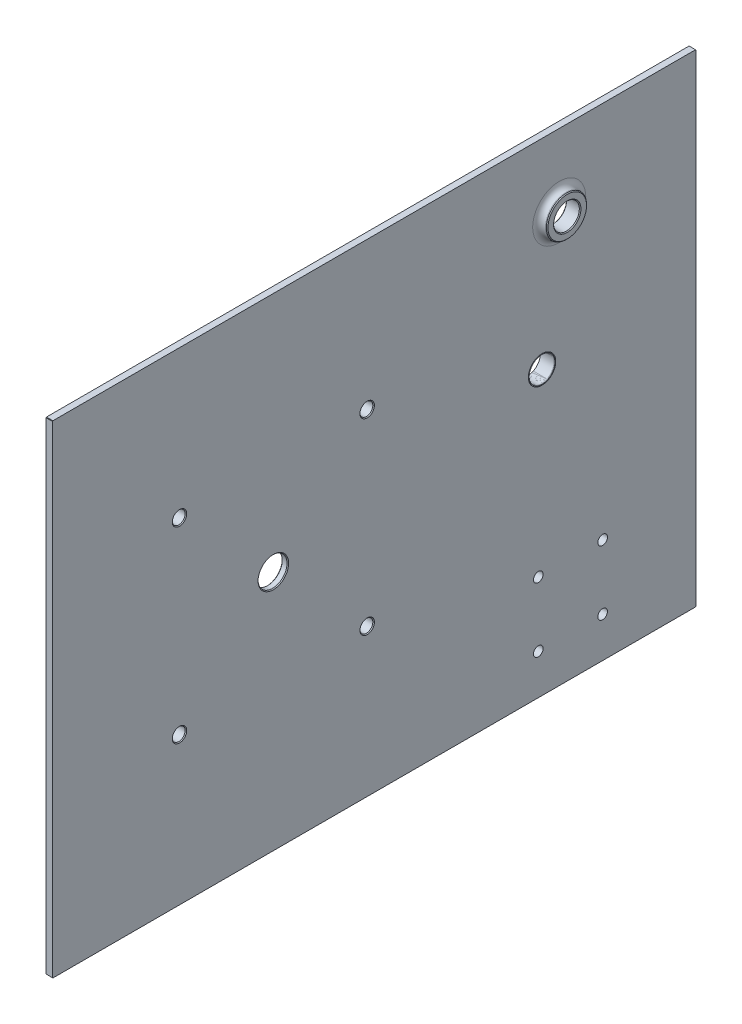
ISO-10303-21;
HEADER;
FILE_DESCRIPTION(('STEP AP214'),'2;1');
FILE_NAME('part.step','',(''),(''),'','','');
FILE_SCHEMA(('AUTOMOTIVE_DESIGN { 1 0 10303 214 1 1 1 1 }'));
ENDSEC;
DATA;
#1=APPLICATION_CONTEXT('core data for automotive mechanical design processes');
#2=APPLICATION_PROTOCOL_DEFINITION('international standard','automotive_design',2000,#1);
#3=PRODUCT_CONTEXT('',#1,'mechanical');
#4=PRODUCT('Part','Part','',(#3));
#5=PRODUCT_RELATED_PRODUCT_CATEGORY('part','',(#4));
#6=PRODUCT_DEFINITION_FORMATION('','',#4);
#7=PRODUCT_DEFINITION_CONTEXT('part definition',#1,'design');
#8=PRODUCT_DEFINITION('design','',#6,#7);
#9=PRODUCT_DEFINITION_SHAPE('','',#8);
#10=(LENGTH_UNIT() NAMED_UNIT(*) SI_UNIT(.MILLI.,.METRE.));
#11=(NAMED_UNIT(*) PLANE_ANGLE_UNIT() SI_UNIT($,.RADIAN.));
#12=(NAMED_UNIT(*) SI_UNIT($,.STERADIAN.) SOLID_ANGLE_UNIT());
#13=UNCERTAINTY_MEASURE_WITH_UNIT(LENGTH_MEASURE(1.E-05),#10,'distance_accuracy_value','');
#14=(GEOMETRIC_REPRESENTATION_CONTEXT(3) GLOBAL_UNCERTAINTY_ASSIGNED_CONTEXT((#13)) GLOBAL_UNIT_ASSIGNED_CONTEXT((#10,
#11,#12)) REPRESENTATION_CONTEXT('',''));
#15=CARTESIAN_POINT('',(0.,0.,0.));
#16=DIRECTION('',(0.,0.,1.));
#17=DIRECTION('',(1.,0.,0.));
#18=AXIS2_PLACEMENT_3D('',#15,#16,#17);
#19=CARTESIAN_POINT('',(9.,105.,-115.));
#20=DIRECTION('',(-1.,0.,0.));
#21=DIRECTION('',(0.,0.,1.));
#22=AXIS2_PLACEMENT_3D('',#19,#20,#21);
#23=CYLINDRICAL_SURFACE('',#22,9.);
#24=CARTESIAN_POINT('',(0.,105.,-115.));
#25=DIRECTION('',(-1.,0.,0.));
#26=DIRECTION('',(0.,0.,1.));
#27=AXIS2_PLACEMENT_3D('',#24,#25,#26);
#28=CIRCLE('',#27,9.);
#29=CARTESIAN_POINT('',(0.,105.,-106.));
#30=VERTEX_POINT('',#29);
#31=EDGE_CURVE('P0_E15',#30,#30,#28,.F.);
#32=ORIENTED_EDGE('',*,*,#31,.T.);
#33=EDGE_LOOP('',(#32));
#34=FACE_BOUND('',#33,.T.);
#35=CARTESIAN_POINT('',(9.,105.,-115.));
#36=DIRECTION('',(-1.,0.,0.));
#37=DIRECTION('',(0.,0.,1.));
#38=AXIS2_PLACEMENT_3D('',#35,#36,#37);
#39=CIRCLE('',#38,9.);
#40=CARTESIAN_POINT('',(9.,105.,-106.));
#41=VERTEX_POINT('',#40);
#42=EDGE_CURVE('P0_E10',#41,#41,#39,.T.);
#43=ORIENTED_EDGE('',*,*,#42,.T.);
#44=EDGE_LOOP('',(#43));
#45=FACE_BOUND('',#44,.T.);
#46=ADVANCED_FACE('P0_F14',(#34,#45),#23,.T.);
#47=OPEN_SHELL('',(#46));
#48=SHELL_BASED_SURFACE_MODEL('P0_B1',(#47));
#49=CARTESIAN_POINT('',(4.,25.607,-104.3299));
#50=DIRECTION('',(1.,0.,0.));
#51=DIRECTION('',(0.,0.,-1.));
#52=AXIS2_PLACEMENT_3D('',#49,#50,#51);
#53=CYLINDRICAL_SURFACE('',#52,8.);
#54=CARTESIAN_POINT('',(-5.,25.607,-104.3299));
#55=DIRECTION('',(1.,0.,0.));
#56=DIRECTION('',(0.,0.,-1.));
#57=AXIS2_PLACEMENT_3D('',#54,#55,#56);
#58=CIRCLE('',#57,8.);
#59=CARTESIAN_POINT('',(-5.,25.607,-112.3299));
#60=VERTEX_POINT('',#59);
#61=EDGE_CURVE('P1_E15',#60,#60,#58,.T.);
#62=ORIENTED_EDGE('',*,*,#61,.T.);
#63=EDGE_LOOP('',(#62));
#64=FACE_BOUND('',#63,.T.);
#65=CARTESIAN_POINT('',(4.,25.607,-104.3299));
#66=DIRECTION('',(1.,0.,0.));
#67=DIRECTION('',(0.,0.,-1.));
#68=AXIS2_PLACEMENT_3D('',#65,#66,#67);
#69=CIRCLE('',#68,8.);
#70=CARTESIAN_POINT('',(4.,25.607,-112.3299));
#71=VERTEX_POINT('',#70);
#72=EDGE_CURVE('P1_E10',#71,#71,#69,.F.);
#73=ORIENTED_EDGE('',*,*,#72,.T.);
#74=EDGE_LOOP('',(#73));
#75=FACE_BOUND('',#74,.T.);
#76=ADVANCED_FACE('P1_F14',(#64,#75),#53,.T.);
#77=OPEN_SHELL('',(#76));
#78=SHELL_BASED_SURFACE_MODEL('P1_B1',(#77));
#79=CARTESIAN_POINT('',(4.,-58.33630944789,4.37349594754));
#80=DIRECTION('',(-1.,0.,0.));
#81=DIRECTION('',(0.,0.,1.));
#82=AXIS2_PLACEMENT_3D('',#79,#80,#81);
#83=CYLINDRICAL_SURFACE('',#82,5.);
#84=CARTESIAN_POINT('',(-5.,-58.33630944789,4.37349594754));
#85=DIRECTION('',(-1.,0.,0.));
#86=DIRECTION('',(0.,0.,1.));
#87=AXIS2_PLACEMENT_3D('',#84,#85,#86);
#88=CIRCLE('',#87,5.);
#89=CARTESIAN_POINT('',(-5.,-58.33630944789,9.37349594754));
#90=VERTEX_POINT('',#89);
#91=EDGE_CURVE('P2_E15',#90,#90,#88,.F.);
#92=ORIENTED_EDGE('',*,*,#91,.T.);
#93=EDGE_LOOP('',(#92));
#94=FACE_BOUND('',#93,.T.);
#95=CARTESIAN_POINT('',(4.,-58.33630944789,4.37349594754));
#96=DIRECTION('',(-1.,0.,0.));
#97=DIRECTION('',(0.,0.,1.));
#98=AXIS2_PLACEMENT_3D('',#95,#96,#97);
#99=CIRCLE('',#98,5.);
#100=CARTESIAN_POINT('',(4.,-58.33630944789,9.37349594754));
#101=VERTEX_POINT('',#100);
#102=EDGE_CURVE('P2_E10',#101,#101,#99,.T.);
#103=ORIENTED_EDGE('',*,*,#102,.T.);
#104=EDGE_LOOP('',(#103));
#105=FACE_BOUND('',#104,.T.);
#106=ADVANCED_FACE('P2_F14',(#94,#105),#83,.T.);
#107=OPEN_SHELL('',(#106));
#108=SHELL_BASED_SURFACE_MODEL('P2_B1',(#107));
#109=CARTESIAN_POINT('',(4.,58.33630944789,4.37349594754));
#110=DIRECTION('',(-1.,0.,0.));
#111=DIRECTION('',(0.,0.,1.));
#112=AXIS2_PLACEMENT_3D('',#109,#110,#111);
#113=CYLINDRICAL_SURFACE('',#112,5.);
#114=CARTESIAN_POINT('',(-5.,58.33630944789,4.37349594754));
#115=DIRECTION('',(-1.,0.,0.));
#116=DIRECTION('',(0.,0.,1.));
#117=AXIS2_PLACEMENT_3D('',#114,#115,#116);
#118=CIRCLE('',#117,5.);
#119=CARTESIAN_POINT('',(-5.,58.33630944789,9.37349594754));
#120=VERTEX_POINT('',#119);
#121=EDGE_CURVE('P3_E15',#120,#120,#118,.F.);
#122=ORIENTED_EDGE('',*,*,#121,.T.);
#123=EDGE_LOOP('',(#122));
#124=FACE_BOUND('',#123,.T.);
#125=CARTESIAN_POINT('',(4.,58.33630944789,4.37349594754));
#126=DIRECTION('',(-1.,0.,0.));
#127=DIRECTION('',(0.,0.,1.));
#128=AXIS2_PLACEMENT_3D('',#125,#126,#127);
#129=CIRCLE('',#128,5.);
#130=CARTESIAN_POINT('',(4.,58.33630944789,9.37349594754));
#131=VERTEX_POINT('',#130);
#132=EDGE_CURVE('P3_E10',#131,#131,#129,.T.);
#133=ORIENTED_EDGE('',*,*,#132,.T.);
#134=EDGE_LOOP('',(#133));
#135=FACE_BOUND('',#134,.T.);
#136=ADVANCED_FACE('P3_F14',(#124,#135),#113,.T.);
#137=OPEN_SHELL('',(#136));
#138=SHELL_BASED_SURFACE_MODEL('P3_B1',(#137));
#139=CARTESIAN_POINT('',(4.,-58.33630944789,121.0461148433));
#140=DIRECTION('',(-1.,0.,0.));
#141=DIRECTION('',(0.,0.,1.));
#142=AXIS2_PLACEMENT_3D('',#139,#140,#141);
#143=CYLINDRICAL_SURFACE('',#142,5.);
#144=CARTESIAN_POINT('',(-5.,-58.33630944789,121.0461148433));
#145=DIRECTION('',(-1.,0.,0.));
#146=DIRECTION('',(0.,0.,1.));
#147=AXIS2_PLACEMENT_3D('',#144,#145,#146);
#148=CIRCLE('',#147,5.);
#149=CARTESIAN_POINT('',(-5.,-58.33630944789,126.0461148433));
#150=VERTEX_POINT('',#149);
#151=EDGE_CURVE('P4_E15',#150,#150,#148,.F.);
#152=ORIENTED_EDGE('',*,*,#151,.T.);
#153=EDGE_LOOP('',(#152));
#154=FACE_BOUND('',#153,.T.);
#155=CARTESIAN_POINT('',(4.,-58.33630944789,121.0461148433));
#156=DIRECTION('',(-1.,0.,0.));
#157=DIRECTION('',(0.,0.,1.));
#158=AXIS2_PLACEMENT_3D('',#155,#156,#157);
#159=CIRCLE('',#158,5.);
#160=CARTESIAN_POINT('',(4.,-58.33630944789,126.0461148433));
#161=VERTEX_POINT('',#160);
#162=EDGE_CURVE('P4_E10',#161,#161,#159,.T.);
#163=ORIENTED_EDGE('',*,*,#162,.T.);
#164=EDGE_LOOP('',(#163));
#165=FACE_BOUND('',#164,.T.);
#166=ADVANCED_FACE('P4_F14',(#154,#165),#143,.T.);
#167=OPEN_SHELL('',(#166));
#168=SHELL_BASED_SURFACE_MODEL('P4_B1',(#167));
#169=CARTESIAN_POINT('',(4.,58.33630944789,121.0461148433));
#170=DIRECTION('',(-1.,0.,0.));
#171=DIRECTION('',(0.,0.,1.));
#172=AXIS2_PLACEMENT_3D('',#169,#170,#171);
#173=CYLINDRICAL_SURFACE('',#172,5.);
#174=CARTESIAN_POINT('',(-5.,58.33630944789,121.0461148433));
#175=DIRECTION('',(-1.,0.,0.));
#176=DIRECTION('',(0.,0.,1.));
#177=AXIS2_PLACEMENT_3D('',#174,#175,#176);
#178=CIRCLE('',#177,5.);
#179=CARTESIAN_POINT('',(-5.,58.33630944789,126.0461148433));
#180=VERTEX_POINT('',#179);
#181=EDGE_CURVE('P5_E15',#180,#180,#178,.F.);
#182=ORIENTED_EDGE('',*,*,#181,.T.);
#183=EDGE_LOOP('',(#182));
#184=FACE_BOUND('',#183,.T.);
#185=CARTESIAN_POINT('',(4.,58.33630944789,121.0461148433));
#186=DIRECTION('',(-1.,0.,0.));
#187=DIRECTION('',(0.,0.,1.));
#188=AXIS2_PLACEMENT_3D('',#185,#186,#187);
#189=CIRCLE('',#188,5.);
#190=CARTESIAN_POINT('',(4.,58.33630944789,126.0461148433));
#191=VERTEX_POINT('',#190);
#192=EDGE_CURVE('P5_E10',#191,#191,#189,.T.);
#193=ORIENTED_EDGE('',*,*,#192,.T.);
#194=EDGE_LOOP('',(#193));
#195=FACE_BOUND('',#194,.T.);
#196=ADVANCED_FACE('P5_F14',(#184,#195),#173,.T.);
#197=OPEN_SHELL('',(#196));
#198=SHELL_BASED_SURFACE_MODEL('P5_B1',(#197));
#199=CARTESIAN_POINT('',(9.,105.,-115.));
#200=DIRECTION('',(1.,0.,0.));
#201=DIRECTION('',(0.,0.,-1.));
#202=AXIS2_PLACEMENT_3D('',#199,#200,#201);
#203=CONICAL_SURFACE('',#202,8.5,0.785398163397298);
#204=CARTESIAN_POINT('',(8.5,105.,-115.));
#205=DIRECTION('',(1.,0.,0.));
#206=DIRECTION('',(0.,0.,-1.));
#207=AXIS2_PLACEMENT_3D('',#204,#205,#206);
#208=CIRCLE('',#207,8.);
#209=CARTESIAN_POINT('',(8.5,105.,-123.));
#210=VERTEX_POINT('',#209);
#211=EDGE_CURVE('P6_E343',#210,#210,#208,.F.);
#212=ORIENTED_EDGE('',*,*,#211,.T.);
#213=EDGE_LOOP('',(#212));
#214=FACE_BOUND('',#213,.T.);
#215=CARTESIAN_POINT('',(9.,105.,-115.));
#216=DIRECTION('',(1.,0.,0.));
#217=DIRECTION('',(0.,0.,-1.));
#218=AXIS2_PLACEMENT_3D('',#215,#216,#217);
#219=CIRCLE('',#218,8.5);
#220=CARTESIAN_POINT('',(9.,105.,-123.5));
#221=VERTEX_POINT('',#220);
#222=EDGE_CURVE('P6_E340',#221,#221,#219,.F.);
#223=ORIENTED_EDGE('',*,*,#222,.F.);
#224=EDGE_LOOP('',(#223));
#225=FACE_BOUND('',#224,.T.);
#226=ADVANCED_FACE('P6_F16',(#214,#225),#203,.F.);
#227=CARTESIAN_POINT('',(-4.5,58.33630944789,4.37349594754));
#228=DIRECTION('',(1.,0.,0.));
#229=DIRECTION('',(0.,0.,-1.));
#230=AXIS2_PLACEMENT_3D('',#227,#228,#229);
#231=CONICAL_SURFACE('',#230,10.,0.785398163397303);
#232=CARTESIAN_POINT('',(-4.5,58.33630944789,4.37349594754));
#233=DIRECTION('',(-1.,0.,0.));
#234=DIRECTION('',(0.,0.,1.));
#235=AXIS2_PLACEMENT_3D('',#232,#233,#234);
#236=CIRCLE('',#235,10.);
#237=CARTESIAN_POINT('',(-4.5,58.33630944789,14.37349594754));
#238=VERTEX_POINT('',#237);
#239=EDGE_CURVE('P6_E703',#238,#238,#236,.F.);
#240=ORIENTED_EDGE('',*,*,#239,.F.);
#241=EDGE_LOOP('',(#240));
#242=FACE_BOUND('',#241,.T.);
#243=CARTESIAN_POINT('',(-5.,58.33630944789,4.37349594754));
#244=DIRECTION('',(1.,0.,0.));
#245=DIRECTION('',(0.,0.,-1.));
#246=AXIS2_PLACEMENT_3D('',#243,#244,#245);
#247=CIRCLE('',#246,9.5);
#248=CARTESIAN_POINT('',(-5.,58.33630944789,-5.12650405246));
#249=VERTEX_POINT('',#248);
#250=EDGE_CURVE('P6_E336',#249,#249,#247,.F.);
#251=ORIENTED_EDGE('',*,*,#250,.F.);
#252=EDGE_LOOP('',(#251));
#253=FACE_BOUND('',#252,.T.);
#254=ADVANCED_FACE('P6_F980',(#242,#253),#231,.T.);
#255=CARTESIAN_POINT('',(-4.5,58.33630944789,121.0461148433));
#256=DIRECTION('',(1.,0.,0.));
#257=DIRECTION('',(0.,0.,-1.));
#258=AXIS2_PLACEMENT_3D('',#255,#256,#257);
#259=CONICAL_SURFACE('',#258,10.,0.785398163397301);
#260=CARTESIAN_POINT('',(-4.5,58.33630944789,121.0461148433));
#261=DIRECTION('',(-1.,0.,0.));
#262=DIRECTION('',(0.,0.,1.));
#263=AXIS2_PLACEMENT_3D('',#260,#261,#262);
#264=CIRCLE('',#263,10.);
#265=CARTESIAN_POINT('',(-4.5,58.33630944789,131.0461148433));
#266=VERTEX_POINT('',#265);
#267=EDGE_CURVE('P6_E700',#266,#266,#264,.F.);
#268=ORIENTED_EDGE('',*,*,#267,.F.);
#269=EDGE_LOOP('',(#268));
#270=FACE_BOUND('',#269,.T.);
#271=CARTESIAN_POINT('',(-5.,58.33630944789,121.0461148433));
#272=DIRECTION('',(1.,0.,0.));
#273=DIRECTION('',(0.,0.,-1.));
#274=AXIS2_PLACEMENT_3D('',#271,#272,#273);
#275=CIRCLE('',#274,9.5);
#276=CARTESIAN_POINT('',(-5.,58.33630944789,111.5461148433));
#277=VERTEX_POINT('',#276);
#278=EDGE_CURVE('P6_E333',#277,#277,#275,.F.);
#279=ORIENTED_EDGE('',*,*,#278,.F.);
#280=EDGE_LOOP('',(#279));
#281=FACE_BOUND('',#280,.T.);
#282=ADVANCED_FACE('P6_F977',(#270,#281),#259,.T.);
#283=CARTESIAN_POINT('',(-4.5,-58.33630944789,121.0461148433));
#284=DIRECTION('',(1.,0.,0.));
#285=DIRECTION('',(0.,0.,-1.));
#286=AXIS2_PLACEMENT_3D('',#283,#284,#285);
#287=CONICAL_SURFACE('',#286,10.,0.785398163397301);
#288=CARTESIAN_POINT('',(-4.5,-58.33630944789,121.0461148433));
#289=DIRECTION('',(-1.,0.,0.));
#290=DIRECTION('',(0.,0.,1.));
#291=AXIS2_PLACEMENT_3D('',#288,#289,#290);
#292=CIRCLE('',#291,10.);
#293=CARTESIAN_POINT('',(-4.5,-58.33630944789,131.0461148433));
#294=VERTEX_POINT('',#293);
#295=EDGE_CURVE('P6_E697',#294,#294,#292,.F.);
#296=ORIENTED_EDGE('',*,*,#295,.F.);
#297=EDGE_LOOP('',(#296));
#298=FACE_BOUND('',#297,.T.);
#299=CARTESIAN_POINT('',(-5.,-58.33630944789,121.0461148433));
#300=DIRECTION('',(1.,0.,0.));
#301=DIRECTION('',(0.,0.,-1.));
#302=AXIS2_PLACEMENT_3D('',#299,#300,#301);
#303=CIRCLE('',#302,9.5);
#304=CARTESIAN_POINT('',(-5.,-58.33630944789,111.5461148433));
#305=VERTEX_POINT('',#304);
#306=EDGE_CURVE('P6_E330',#305,#305,#303,.F.);
#307=ORIENTED_EDGE('',*,*,#306,.F.);
#308=EDGE_LOOP('',(#307));
#309=FACE_BOUND('',#308,.T.);
#310=ADVANCED_FACE('P6_F979',(#298,#309),#287,.T.);
#311=CARTESIAN_POINT('',(-4.5,-58.33630944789,4.37349594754));
#312=DIRECTION('',(1.,0.,0.));
#313=DIRECTION('',(0.,0.,-1.));
#314=AXIS2_PLACEMENT_3D('',#311,#312,#313);
#315=CONICAL_SURFACE('',#314,10.,0.785398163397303);
#316=CARTESIAN_POINT('',(-4.5,-58.33630944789,4.37349594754));
#317=DIRECTION('',(-1.,0.,0.));
#318=DIRECTION('',(0.,0.,1.));
#319=AXIS2_PLACEMENT_3D('',#316,#317,#318);
#320=CIRCLE('',#319,10.);
#321=CARTESIAN_POINT('',(-4.5,-58.33630944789,14.37349594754));
#322=VERTEX_POINT('',#321);
#323=EDGE_CURVE('P6_E694',#322,#322,#320,.F.);
#324=ORIENTED_EDGE('',*,*,#323,.F.);
#325=EDGE_LOOP('',(#324));
#326=FACE_BOUND('',#325,.T.);
#327=CARTESIAN_POINT('',(-5.,-58.33630944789,4.37349594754));
#328=DIRECTION('',(1.,0.,0.));
#329=DIRECTION('',(0.,0.,-1.));
#330=AXIS2_PLACEMENT_3D('',#327,#328,#329);
#331=CIRCLE('',#330,9.5);
#332=CARTESIAN_POINT('',(-5.,-58.33630944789,-5.12650405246));
#333=VERTEX_POINT('',#332);
#334=EDGE_CURVE('P6_E326',#333,#333,#331,.F.);
#335=ORIENTED_EDGE('',*,*,#334,.F.);
#336=EDGE_LOOP('',(#335));
#337=FACE_BOUND('',#336,.T.);
#338=ADVANCED_FACE('P6_F988',(#326,#337),#315,.T.);
#339=CARTESIAN_POINT('',(0.,58.33630944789,4.37349594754));
#340=DIRECTION('',(-1.,0.,0.));
#341=DIRECTION('',(0.,0.,1.));
#342=AXIS2_PLACEMENT_3D('',#339,#340,#341);
#343=CYLINDRICAL_SURFACE('',#342,10.);
#344=CARTESIAN_POINT('',(-2.5,58.33630944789,4.37349594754));
#345=DIRECTION('',(-1.,0.,0.));
#346=DIRECTION('',(0.,-0.0844682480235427,0.99642617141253));
#347=AXIS2_PLACEMENT_3D('',#344,#345,#346);
#348=CIRCLE('',#347,10.);
#349=CARTESIAN_POINT('',(-2.5,57.4916269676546,14.3377576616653));
#350=VERTEX_POINT('',#349);
#351=EDGE_CURVE('P6_E329',#350,#350,#348,.T.);
#352=ORIENTED_EDGE('',*,*,#351,.T.);
#353=EDGE_LOOP('',(#352));
#354=FACE_BOUND('',#353,.T.);
#355=ORIENTED_EDGE('',*,*,#239,.T.);
#356=EDGE_LOOP('',(#355));
#357=FACE_BOUND('',#356,.T.);
#358=ADVANCED_FACE('P6_F996',(#354,#357),#343,.T.);
#359=CARTESIAN_POINT('',(0.,58.33630944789,121.0461148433));
#360=DIRECTION('',(-1.,0.,0.));
#361=DIRECTION('',(0.,0.,1.));
#362=AXIS2_PLACEMENT_3D('',#359,#360,#361);
#363=CYLINDRICAL_SURFACE('',#362,10.);
#364=CARTESIAN_POINT('',(-2.5,58.33630944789,121.0461148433));
#365=DIRECTION('',(-1.,0.,0.));
#366=DIRECTION('',(0.,-0.0844682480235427,0.99642617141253));
#367=AXIS2_PLACEMENT_3D('',#364,#365,#366);
#368=CIRCLE('',#367,10.);
#369=CARTESIAN_POINT('',(-2.5,57.4916269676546,131.010376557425));
#370=VERTEX_POINT('',#369);
#371=EDGE_CURVE('P6_E685',#370,#370,#368,.T.);
#372=ORIENTED_EDGE('',*,*,#371,.T.);
#373=EDGE_LOOP('',(#372));
#374=FACE_BOUND('',#373,.T.);
#375=ORIENTED_EDGE('',*,*,#267,.T.);
#376=EDGE_LOOP('',(#375));
#377=FACE_BOUND('',#376,.T.);
#378=ADVANCED_FACE('P6_F1000',(#374,#377),#363,.T.);
#379=CARTESIAN_POINT('',(0.,-58.33630944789,121.0461148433));
#380=DIRECTION('',(-1.,0.,0.));
#381=DIRECTION('',(0.,0.,1.));
#382=AXIS2_PLACEMENT_3D('',#379,#380,#381);
#383=CYLINDRICAL_SURFACE('',#382,10.);
#384=CARTESIAN_POINT('',(-2.5,-58.33630944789,121.0461148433));
#385=DIRECTION('',(-1.,0.,0.));
#386=DIRECTION('',(0.,-0.0844682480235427,0.99642617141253));
#387=AXIS2_PLACEMENT_3D('',#384,#385,#386);
#388=CIRCLE('',#387,10.);
#389=CARTESIAN_POINT('',(-2.5,-59.1809919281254,131.010376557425));
#390=VERTEX_POINT('',#389);
#391=EDGE_CURVE('P6_E682',#390,#390,#388,.T.);
#392=ORIENTED_EDGE('',*,*,#391,.T.);
#393=EDGE_LOOP('',(#392));
#394=FACE_BOUND('',#393,.T.);
#395=ORIENTED_EDGE('',*,*,#295,.T.);
#396=EDGE_LOOP('',(#395));
#397=FACE_BOUND('',#396,.T.);
#398=ADVANCED_FACE('P6_F1004',(#394,#397),#383,.T.);
#399=CARTESIAN_POINT('',(0.,-58.33630944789,4.37349594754));
#400=DIRECTION('',(-1.,0.,0.));
#401=DIRECTION('',(0.,0.,1.));
#402=AXIS2_PLACEMENT_3D('',#399,#400,#401);
#403=CYLINDRICAL_SURFACE('',#402,10.);
#404=CARTESIAN_POINT('',(-2.5,-58.33630944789,4.37349594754));
#405=DIRECTION('',(-1.,0.,0.));
#406=DIRECTION('',(0.,-0.0844682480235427,0.99642617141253));
#407=AXIS2_PLACEMENT_3D('',#404,#405,#406);
#408=CIRCLE('',#407,10.);
#409=CARTESIAN_POINT('',(-2.5,-59.1809919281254,14.3377576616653));
#410=VERTEX_POINT('',#409);
#411=EDGE_CURVE('P6_E679',#410,#410,#408,.T.);
#412=ORIENTED_EDGE('',*,*,#411,.T.);
#413=EDGE_LOOP('',(#412));
#414=FACE_BOUND('',#413,.T.);
#415=ORIENTED_EDGE('',*,*,#323,.T.);
#416=EDGE_LOOP('',(#415));
#417=FACE_BOUND('',#416,.T.);
#418=ADVANCED_FACE('P6_F1008',(#414,#417),#403,.T.);
#419=CARTESIAN_POINT('',(0.,25.607,-104.3299));
#420=DIRECTION('',(-1.,0.,0.));
#421=DIRECTION('',(0.,0.,1.));
#422=AXIS2_PLACEMENT_3D('',#419,#420,#421);
#423=CYLINDRICAL_SURFACE('',#422,11.);
#424=CARTESIAN_POINT('',(-2.5,25.607,-104.3299));
#425=DIRECTION('',(-1.,0.,0.));
#426=DIRECTION('',(0.,0.997046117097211,0.0768052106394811));
#427=AXIS2_PLACEMENT_3D('',#424,#425,#426);
#428=CIRCLE('',#427,11.);
#429=CARTESIAN_POINT('',(-2.5,36.5745072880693,-103.485042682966));
#430=VERTEX_POINT('',#429);
#431=EDGE_CURVE('P6_E676',#430,#430,#428,.T.);
#432=ORIENTED_EDGE('',*,*,#431,.T.);
#433=EDGE_LOOP('',(#432));
#434=FACE_BOUND('',#433,.T.);
#435=CARTESIAN_POINT('',(-4.50000000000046,25.607,-104.3299));
#436=DIRECTION('',(1.,0.,0.));
#437=DIRECTION('',(0.,0.,-1.));
#438=AXIS2_PLACEMENT_3D('',#435,#436,#437);
#439=CIRCLE('',#438,11.0000000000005);
#440=CARTESIAN_POINT('',(-4.50000000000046,25.607,-115.3299));
#441=VERTEX_POINT('',#440);
#442=EDGE_CURVE('P6_E339',#441,#441,#439,.F.);
#443=ORIENTED_EDGE('',*,*,#442,.F.);
#444=EDGE_LOOP('',(#443));
#445=FACE_BOUND('',#444,.T.);
#446=ADVANCED_FACE('P6_F1012',(#434,#445),#423,.T.);
#447=CARTESIAN_POINT('',(4.,105.,-115.));
#448=DIRECTION('',(1.,0.,0.));
#449=DIRECTION('',(0.,0.,-1.));
#450=AXIS2_PLACEMENT_3D('',#447,#448,#449);
#451=CYLINDRICAL_SURFACE('',#450,8.);
#452=ORIENTED_EDGE('',*,*,#211,.F.);
#453=EDGE_LOOP('',(#452));
#454=FACE_BOUND('',#453,.T.);
#455=CARTESIAN_POINT('',(0.499999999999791,105.,-115.));
#456=DIRECTION('',(-1.,0.,0.));
#457=DIRECTION('',(0.,0.,-1.));
#458=AXIS2_PLACEMENT_3D('',#455,#456,#457);
#459=CIRCLE('',#458,7.99999999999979);
#460=CARTESIAN_POINT('',(0.499999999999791,105.,-123.));
#461=VERTEX_POINT('',#460);
#462=EDGE_CURVE('P6_E673',#461,#461,#459,.T.);
#463=ORIENTED_EDGE('',*,*,#462,.T.);
#464=EDGE_LOOP('',(#463));
#465=FACE_BOUND('',#464,.T.);
#466=ADVANCED_FACE('P6_F1016',(#454,#465),#451,.F.);
#467=CARTESIAN_POINT('',(9.,0.,0.));
#468=DIRECTION('',(1.,0.,0.));
#469=DIRECTION('',(0.,0.,-1.));
#470=AXIS2_PLACEMENT_3D('',#467,#468,#469);
#471=PLANE('',#470);
#472=ORIENTED_EDGE('',*,*,#222,.T.);
#473=EDGE_LOOP('',(#472));
#474=FACE_BOUND('',#473,.T.);
#475=CARTESIAN_POINT('',(8.99999999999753,105.,-115.));
#476=DIRECTION('',(-1.,0.,0.));
#477=DIRECTION('',(0.,0.,1.));
#478=AXIS2_PLACEMENT_3D('',#475,#476,#477);
#479=CIRCLE('',#478,11.9999999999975);
#480=CARTESIAN_POINT('',(8.99999999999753,105.,-103.000000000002));
#481=VERTEX_POINT('',#480);
#482=EDGE_CURVE('P6_E322',#481,#481,#479,.T.);
#483=ORIENTED_EDGE('',*,*,#482,.F.);
#484=EDGE_LOOP('',(#483));
#485=FACE_BOUND('',#484,.T.);
#486=ADVANCED_FACE('P6_F1020',(#474,#485),#471,.T.);
#487=CARTESIAN_POINT('',(-4.50000000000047,25.607,-104.3299));
#488=DIRECTION('',(1.,0.,0.));
#489=DIRECTION('',(0.,0.,-1.));
#490=AXIS2_PLACEMENT_3D('',#487,#488,#489);
#491=CONICAL_SURFACE('',#490,11.0000000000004,0.785398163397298);
#492=ORIENTED_EDGE('',*,*,#442,.T.);
#493=EDGE_LOOP('',(#492));
#494=FACE_BOUND('',#493,.T.);
#495=CARTESIAN_POINT('',(-5.00000000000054,25.607,-104.3299));
#496=DIRECTION('',(1.,0.,0.));
#497=DIRECTION('',(0.,0.,-1.));
#498=AXIS2_PLACEMENT_3D('',#495,#496,#497);
#499=CIRCLE('',#498,10.5000000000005);
#500=CARTESIAN_POINT('',(-5.00000000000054,25.607,-114.829900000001));
#501=VERTEX_POINT('',#500);
#502=EDGE_CURVE('P6_E319',#501,#501,#499,.F.);
#503=ORIENTED_EDGE('',*,*,#502,.F.);
#504=EDGE_LOOP('',(#503));
#505=FACE_BOUND('',#504,.T.);
#506=ADVANCED_FACE('P6_F1024',(#494,#505),#491,.T.);
#507=CARTESIAN_POINT('',(-5.,0.,0.));
#508=DIRECTION('',(-1.,0.,0.));
#509=DIRECTION('',(0.,0.,1.));
#510=AXIS2_PLACEMENT_3D('',#507,#508,#509);
#511=PLANE('',#510);
#512=CARTESIAN_POINT('',(-4.99999999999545,58.33630944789,4.37349594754));
#513=DIRECTION('',(-1.,0.,0.));
#514=DIRECTION('',(0.,0.,1.));
#515=AXIS2_PLACEMENT_3D('',#512,#513,#514);
#516=CIRCLE('',#515,4.5000000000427);
#517=CARTESIAN_POINT('',(-4.99999999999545,58.33630944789,8.8734959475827));
#518=VERTEX_POINT('',#517);
#519=EDGE_CURVE('P6_E316',#518,#518,#516,.F.);
#520=ORIENTED_EDGE('',*,*,#519,.T.);
#521=EDGE_LOOP('',(#520));
#522=FACE_BOUND('',#521,.T.);
#523=ORIENTED_EDGE('',*,*,#250,.T.);
#524=EDGE_LOOP('',(#523));
#525=FACE_BOUND('',#524,.T.);
#526=ADVANCED_FACE('P6_F973',(#522,#525),#511,.T.);
#527=CARTESIAN_POINT('',(-5.,0.,0.));
#528=DIRECTION('',(-1.,0.,0.));
#529=DIRECTION('',(0.,0.,1.));
#530=AXIS2_PLACEMENT_3D('',#527,#528,#529);
#531=PLANE('',#530);
#532=CARTESIAN_POINT('',(-5.0000000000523,58.33630944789,121.0461148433));
#533=DIRECTION('',(-1.,0.,0.));
#534=DIRECTION('',(0.,0.,1.));
#535=AXIS2_PLACEMENT_3D('',#532,#533,#534);
#536=CIRCLE('',#535,4.50000000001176);
#537=CARTESIAN_POINT('',(-5.0000000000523,58.33630944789,125.546114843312));
#538=VERTEX_POINT('',#537);
#539=EDGE_CURVE('P6_E313',#538,#538,#536,.F.);
#540=ORIENTED_EDGE('',*,*,#539,.T.);
#541=EDGE_LOOP('',(#540));
#542=FACE_BOUND('',#541,.T.);
#543=ORIENTED_EDGE('',*,*,#278,.T.);
#544=EDGE_LOOP('',(#543));
#545=FACE_BOUND('',#544,.T.);
#546=ADVANCED_FACE('P6_F969',(#542,#545),#531,.T.);
#547=CARTESIAN_POINT('',(-5.,0.,0.));
#548=DIRECTION('',(-1.,0.,0.));
#549=DIRECTION('',(0.,0.,1.));
#550=AXIS2_PLACEMENT_3D('',#547,#548,#549);
#551=PLANE('',#550);
#552=CARTESIAN_POINT('',(-5.0000000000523,-58.33630944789,121.0461148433));
#553=DIRECTION('',(-1.,0.,0.));
#554=DIRECTION('',(0.,0.,1.));
#555=AXIS2_PLACEMENT_3D('',#552,#553,#554);
#556=CIRCLE('',#555,4.50000000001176);
#557=CARTESIAN_POINT('',(-5.0000000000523,-58.33630944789,125.546114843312));
#558=VERTEX_POINT('',#557);
#559=EDGE_CURVE('P6_E310',#558,#558,#556,.F.);
#560=ORIENTED_EDGE('',*,*,#559,.T.);
#561=EDGE_LOOP('',(#560));
#562=FACE_BOUND('',#561,.T.);
#563=ORIENTED_EDGE('',*,*,#306,.T.);
#564=EDGE_LOOP('',(#563));
#565=FACE_BOUND('',#564,.T.);
#566=ADVANCED_FACE('P6_F972',(#562,#565),#551,.T.);
#567=CARTESIAN_POINT('',(-5.,0.,0.));
#568=DIRECTION('',(-1.,0.,0.));
#569=DIRECTION('',(0.,0.,1.));
#570=AXIS2_PLACEMENT_3D('',#567,#568,#569);
#571=PLANE('',#570);
#572=CARTESIAN_POINT('',(-4.99999999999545,-58.33630944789,4.37349594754));
#573=DIRECTION('',(-1.,0.,0.));
#574=DIRECTION('',(0.,0.,1.));
#575=AXIS2_PLACEMENT_3D('',#572,#573,#574);
#576=CIRCLE('',#575,4.5000000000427);
#577=CARTESIAN_POINT('',(-4.99999999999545,-58.33630944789,8.8734959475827));
#578=VERTEX_POINT('',#577);
#579=EDGE_CURVE('P6_E306',#578,#578,#576,.F.);
#580=ORIENTED_EDGE('',*,*,#579,.T.);
#581=EDGE_LOOP('',(#580));
#582=FACE_BOUND('',#581,.T.);
#583=ORIENTED_EDGE('',*,*,#334,.T.);
#584=EDGE_LOOP('',(#583));
#585=FACE_BOUND('',#584,.T.);
#586=ADVANCED_FACE('P6_F1034',(#582,#585),#571,.T.);
#587=CARTESIAN_POINT('',(0.,-125.,-142.));
#588=DIRECTION('',(-1.,0.,0.));
#589=DIRECTION('',(0.,0.,1.));
#590=AXIS2_PLACEMENT_3D('',#587,#588,#589);
#591=CYLINDRICAL_SURFACE('',#590,7.);
#592=CARTESIAN_POINT('',(-4.49999999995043,-125.,-142.));
#593=DIRECTION('',(1.,0.,0.));
#594=DIRECTION('',(0.,0.,-1.));
#595=AXIS2_PLACEMENT_3D('',#592,#593,#594);
#596=CIRCLE('',#595,7.00000000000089);
#597=CARTESIAN_POINT('',(-4.49999999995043,-125.,-149.000000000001));
#598=VERTEX_POINT('',#597);
#599=EDGE_CURVE('P6_E309',#598,#598,#596,.F.);
#600=ORIENTED_EDGE('',*,*,#599,.F.);
#601=EDGE_LOOP('',(#600));
#602=FACE_BOUND('',#601,.T.);
#603=CARTESIAN_POINT('',(-2.5,-125.,-142.));
#604=DIRECTION('',(-1.,0.,0.));
#605=DIRECTION('',(0.,0.992710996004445,0.120519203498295));
#606=AXIS2_PLACEMENT_3D('',#603,#604,#605);
#607=CIRCLE('',#606,7.);
#608=CARTESIAN_POINT('',(-2.5,-118.051023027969,-141.156365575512));
#609=VERTEX_POINT('',#608);
#610=EDGE_CURVE('P6_E667',#609,#609,#607,.T.);
#611=ORIENTED_EDGE('',*,*,#610,.T.);
#612=EDGE_LOOP('',(#611));
#613=FACE_BOUND('',#612,.T.);
#614=ADVANCED_FACE('P6_F1038',(#602,#613),#591,.T.);
#615=CARTESIAN_POINT('',(0.,-125.,-102.));
#616=DIRECTION('',(-1.,0.,0.));
#617=DIRECTION('',(0.,0.,1.));
#618=AXIS2_PLACEMENT_3D('',#615,#616,#617);
#619=CYLINDRICAL_SURFACE('',#618,7.);
#620=CARTESIAN_POINT('',(-4.50000000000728,-125.,-102.));
#621=DIRECTION('',(1.,0.,0.));
#622=DIRECTION('',(0.,0.,-1.));
#623=AXIS2_PLACEMENT_3D('',#620,#621,#622);
#624=CIRCLE('',#623,6.99999999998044);
#625=CARTESIAN_POINT('',(-4.50000000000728,-125.,-108.99999999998));
#626=VERTEX_POINT('',#625);
#627=EDGE_CURVE('P6_E657',#626,#626,#624,.F.);
#628=ORIENTED_EDGE('',*,*,#627,.F.);
#629=EDGE_LOOP('',(#628));
#630=FACE_BOUND('',#629,.T.);
#631=CARTESIAN_POINT('',(-2.5,-125.,-102.));
#632=DIRECTION('',(-1.,0.,0.));
#633=DIRECTION('',(0.,0.992710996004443,0.120519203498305));
#634=AXIS2_PLACEMENT_3D('',#631,#632,#633);
#635=CIRCLE('',#634,7.);
#636=CARTESIAN_POINT('',(-2.5,-118.051023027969,-101.156365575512));
#637=VERTEX_POINT('',#636);
#638=EDGE_CURVE('P6_E664',#637,#637,#635,.T.);
#639=ORIENTED_EDGE('',*,*,#638,.T.);
#640=EDGE_LOOP('',(#639));
#641=FACE_BOUND('',#640,.T.);
#642=ADVANCED_FACE('P6_F1042',(#630,#641),#619,.T.);
#643=CARTESIAN_POINT('',(0.,-85.,-142.));
#644=DIRECTION('',(-1.,0.,0.));
#645=DIRECTION('',(0.,0.,1.));
#646=AXIS2_PLACEMENT_3D('',#643,#644,#645);
#647=CYLINDRICAL_SURFACE('',#646,7.);
#648=CARTESIAN_POINT('',(-4.49999999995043,-85.,-142.));
#649=DIRECTION('',(1.,0.,0.));
#650=DIRECTION('',(0.,0.,-1.));
#651=AXIS2_PLACEMENT_3D('',#648,#649,#650);
#652=CIRCLE('',#651,7.00000000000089);
#653=CARTESIAN_POINT('',(-4.49999999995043,-85.,-149.000000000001));
#654=VERTEX_POINT('',#653);
#655=EDGE_CURVE('P6_E654',#654,#654,#652,.F.);
#656=ORIENTED_EDGE('',*,*,#655,.F.);
#657=EDGE_LOOP('',(#656));
#658=FACE_BOUND('',#657,.T.);
#659=CARTESIAN_POINT('',(-2.5,-85.,-142.));
#660=DIRECTION('',(-1.,0.,0.));
#661=DIRECTION('',(0.,-0.992710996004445,-0.120519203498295));
#662=AXIS2_PLACEMENT_3D('',#659,#660,#661);
#663=CIRCLE('',#662,7.);
#664=CARTESIAN_POINT('',(-2.5,-91.9489769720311,-142.843634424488));
#665=VERTEX_POINT('',#664);
#666=EDGE_CURVE('P6_E670',#665,#665,#663,.T.);
#667=ORIENTED_EDGE('',*,*,#666,.T.);
#668=EDGE_LOOP('',(#667));
#669=FACE_BOUND('',#668,.T.);
#670=ADVANCED_FACE('P6_F1045',(#658,#669),#647,.T.);
#671=CARTESIAN_POINT('',(0.,-85.,-102.));
#672=DIRECTION('',(-1.,0.,0.));
#673=DIRECTION('',(0.,0.,1.));
#674=AXIS2_PLACEMENT_3D('',#671,#672,#673);
#675=CYLINDRICAL_SURFACE('',#674,7.);
#676=CARTESIAN_POINT('',(-4.50000000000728,-85.,-102.));
#677=DIRECTION('',(1.,0.,0.));
#678=DIRECTION('',(0.,0.,-1.));
#679=AXIS2_PLACEMENT_3D('',#676,#677,#678);
#680=CIRCLE('',#679,6.99999999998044);
#681=CARTESIAN_POINT('',(-4.50000000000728,-85.,-108.99999999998));
#682=VERTEX_POINT('',#681);
#683=EDGE_CURVE('P6_E645',#682,#682,#680,.F.);
#684=ORIENTED_EDGE('',*,*,#683,.F.);
#685=EDGE_LOOP('',(#684));
#686=FACE_BOUND('',#685,.T.);
#687=CARTESIAN_POINT('',(-2.5,-85.,-102.));
#688=DIRECTION('',(-1.,0.,0.));
#689=DIRECTION('',(0.,0.992710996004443,0.120519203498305));
#690=AXIS2_PLACEMENT_3D('',#687,#688,#689);
#691=CIRCLE('',#690,7.);
#692=CARTESIAN_POINT('',(-2.5,-78.0510230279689,-101.156365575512));
#693=VERTEX_POINT('',#692);
#694=EDGE_CURVE('P6_E325',#693,#693,#691,.T.);
#695=ORIENTED_EDGE('',*,*,#694,.T.);
#696=EDGE_LOOP('',(#695));
#697=FACE_BOUND('',#696,.T.);
#698=ADVANCED_FACE('P6_F638',(#686,#697),#675,.T.);
#699=CARTESIAN_POINT('',(-2.5,58.33630944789,4.37349594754));
#700=DIRECTION('',(-1.,0.,0.));
#701=DIRECTION('',(0.,-0.0844682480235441,0.99642617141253));
#702=AXIS2_PLACEMENT_3D('',#699,#700,#701);
#703=TOROIDAL_SURFACE('',#702,12.5,2.5);
#704=ORIENTED_EDGE('',*,*,#351,.F.);
#705=EDGE_LOOP('',(#704));
#706=FACE_BOUND('',#705,.T.);
#707=CARTESIAN_POINT('',(0.,58.33630944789,4.37349594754));
#708=DIRECTION('',(-1.,0.,0.));
#709=DIRECTION('',(0.,0.,-1.));
#710=AXIS2_PLACEMENT_3D('',#707,#708,#709);
#711=CIRCLE('',#710,12.5);
#712=CARTESIAN_POINT('',(0.,58.33630944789,-8.12650405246));
#713=VERTEX_POINT('',#712);
#714=CARTESIAN_POINT('',(0.,58.33630944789,16.87349594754));
#715=VERTEX_POINT('',#714);
#716=EDGE_CURVE('P6_E133',#713,#715,#711,.T.);
#717=ORIENTED_EDGE('',*,*,#716,.T.);
#718=CARTESIAN_POINT('',(0.,58.33630944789,4.37349594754));
#719=DIRECTION('',(-1.,0.,0.));
#720=DIRECTION('',(0.,0.,1.));
#721=AXIS2_PLACEMENT_3D('',#718,#719,#720);
#722=CIRCLE('',#721,12.5);
#723=EDGE_CURVE('P6_E136',#715,#713,#722,.T.);
#724=ORIENTED_EDGE('',*,*,#723,.T.);
#725=EDGE_LOOP('',(#717,#724));
#726=FACE_BOUND('',#725,.T.);
#727=ADVANCED_FACE('P6_F135',(#706,#726),#703,.F.);
#728=CARTESIAN_POINT('',(-2.5,58.33630944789,121.0461148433));
#729=DIRECTION('',(-1.,0.,0.));
#730=DIRECTION('',(0.,-0.0844682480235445,0.99642617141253));
#731=AXIS2_PLACEMENT_3D('',#728,#729,#730);
#732=TOROIDAL_SURFACE('',#731,12.5,2.5);
#733=ORIENTED_EDGE('',*,*,#371,.F.);
#734=EDGE_LOOP('',(#733));
#735=FACE_BOUND('',#734,.T.);
#736=CARTESIAN_POINT('',(0.,58.33630944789,121.0461148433));
#737=DIRECTION('',(-1.,0.,0.));
#738=DIRECTION('',(0.,0.,-1.));
#739=AXIS2_PLACEMENT_3D('',#736,#737,#738);
#740=CIRCLE('',#739,12.5);
#741=CARTESIAN_POINT('',(0.,58.33630944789,108.5461148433));
#742=VERTEX_POINT('',#741);
#743=CARTESIAN_POINT('',(0.,58.33630944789,133.5461148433));
#744=VERTEX_POINT('',#743);
#745=EDGE_CURVE('P6_E145',#742,#744,#740,.T.);
#746=ORIENTED_EDGE('',*,*,#745,.T.);
#747=CARTESIAN_POINT('',(0.,58.33630944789,121.0461148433));
#748=DIRECTION('',(-1.,0.,0.));
#749=DIRECTION('',(0.,0.,1.));
#750=AXIS2_PLACEMENT_3D('',#747,#748,#749);
#751=CIRCLE('',#750,12.5);
#752=EDGE_CURVE('P6_E624',#744,#742,#751,.T.);
#753=ORIENTED_EDGE('',*,*,#752,.T.);
#754=EDGE_LOOP('',(#746,#753));
#755=FACE_BOUND('',#754,.T.);
#756=ADVANCED_FACE('P6_F599',(#735,#755),#732,.F.);
#757=CARTESIAN_POINT('',(-2.5,-58.33630944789,121.0461148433));
#758=DIRECTION('',(-1.,0.,0.));
#759=DIRECTION('',(0.,-0.0844682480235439,0.99642617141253));
#760=AXIS2_PLACEMENT_3D('',#757,#758,#759);
#761=TOROIDAL_SURFACE('',#760,12.5,2.5);
#762=ORIENTED_EDGE('',*,*,#391,.F.);
#763=EDGE_LOOP('',(#762));
#764=FACE_BOUND('',#763,.T.);
#765=CARTESIAN_POINT('',(0.,-58.33630944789,121.0461148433));
#766=DIRECTION('',(-1.,0.,0.));
#767=DIRECTION('',(0.,0.,-1.));
#768=AXIS2_PLACEMENT_3D('',#765,#766,#767);
#769=CIRCLE('',#768,12.5);
#770=CARTESIAN_POINT('',(0.,-58.33630944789,108.5461148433));
#771=VERTEX_POINT('',#770);
#772=CARTESIAN_POINT('',(0.,-58.33630944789,133.5461148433));
#773=VERTEX_POINT('',#772);
#774=EDGE_CURVE('P6_E584',#771,#773,#769,.T.);
#775=ORIENTED_EDGE('',*,*,#774,.T.);
#776=CARTESIAN_POINT('',(0.,-58.33630944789,121.0461148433));
#777=DIRECTION('',(-1.,0.,0.));
#778=DIRECTION('',(0.,0.,1.));
#779=AXIS2_PLACEMENT_3D('',#776,#777,#778);
#780=CIRCLE('',#779,12.5);
#781=EDGE_CURVE('P6_E611',#773,#771,#780,.T.);
#782=ORIENTED_EDGE('',*,*,#781,.T.);
#783=EDGE_LOOP('',(#775,#782));
#784=FACE_BOUND('',#783,.T.);
#785=ADVANCED_FACE('P6_F589',(#764,#784),#761,.F.);
#786=CARTESIAN_POINT('',(-2.5,-58.33630944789,4.37349594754));
#787=DIRECTION('',(-1.,0.,0.));
#788=DIRECTION('',(0.,-0.0844682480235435,0.99642617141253));
#789=AXIS2_PLACEMENT_3D('',#786,#787,#788);
#790=TOROIDAL_SURFACE('',#789,12.5,2.5);
#791=ORIENTED_EDGE('',*,*,#411,.F.);
#792=EDGE_LOOP('',(#791));
#793=FACE_BOUND('',#792,.T.);
#794=CARTESIAN_POINT('',(0.,-58.33630944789,4.37349594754));
#795=DIRECTION('',(-1.,0.,0.));
#796=DIRECTION('',(0.,0.,-1.));
#797=AXIS2_PLACEMENT_3D('',#794,#795,#796);
#798=CIRCLE('',#797,12.5);
#799=CARTESIAN_POINT('',(0.,-58.33630944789,-8.12650405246));
#800=VERTEX_POINT('',#799);
#801=CARTESIAN_POINT('',(0.,-58.33630944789,16.87349594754));
#802=VERTEX_POINT('',#801);
#803=EDGE_CURVE('P6_E571',#800,#802,#798,.T.);
#804=ORIENTED_EDGE('',*,*,#803,.T.);
#805=CARTESIAN_POINT('',(0.,-58.33630944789,4.37349594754));
#806=DIRECTION('',(-1.,0.,0.));
#807=DIRECTION('',(0.,0.,1.));
#808=AXIS2_PLACEMENT_3D('',#805,#806,#807);
#809=CIRCLE('',#808,12.5);
#810=EDGE_CURVE('P6_E1683',#802,#800,#809,.T.);
#811=ORIENTED_EDGE('',*,*,#810,.T.);
#812=EDGE_LOOP('',(#804,#811));
#813=FACE_BOUND('',#812,.T.);
#814=ADVANCED_FACE('P6_F550',(#793,#813),#790,.F.);
#815=CARTESIAN_POINT('',(-2.5,25.607,-104.3299));
#816=DIRECTION('',(-1.,0.,0.));
#817=DIRECTION('',(0.,0.997046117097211,0.0768052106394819));
#818=AXIS2_PLACEMENT_3D('',#815,#816,#817);
#819=TOROIDAL_SURFACE('',#818,13.5,2.5);
#820=ORIENTED_EDGE('',*,*,#431,.F.);
#821=EDGE_LOOP('',(#820));
#822=FACE_BOUND('',#821,.T.);
#823=CARTESIAN_POINT('',(0.,25.607,-104.3299));
#824=DIRECTION('',(-1.,0.,0.));
#825=DIRECTION('',(0.,-1.,0.));
#826=AXIS2_PLACEMENT_3D('',#823,#824,#825);
#827=CIRCLE('',#826,13.5);
#828=CARTESIAN_POINT('',(0.,12.107,-104.3299));
#829=VERTEX_POINT('',#828);
#830=CARTESIAN_POINT('',(0.,39.107,-104.3299));
#831=VERTEX_POINT('',#830);
#832=EDGE_CURVE('P6_E1684',#829,#831,#827,.T.);
#833=ORIENTED_EDGE('',*,*,#832,.T.);
#834=CARTESIAN_POINT('',(0.,25.607,-104.3299));
#835=DIRECTION('',(-1.,0.,0.));
#836=DIRECTION('',(0.,1.,0.));
#837=AXIS2_PLACEMENT_3D('',#834,#835,#836);
#838=CIRCLE('',#837,13.5);
#839=EDGE_CURVE('P6_E300',#831,#829,#838,.T.);
#840=ORIENTED_EDGE('',*,*,#839,.T.);
#841=EDGE_LOOP('',(#833,#840));
#842=FACE_BOUND('',#841,.T.);
#843=ADVANCED_FACE('P6_F545',(#822,#842),#819,.F.);
#844=CARTESIAN_POINT('',(-2.91867224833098E-13,105.,-115.));
#845=DIRECTION('',(-1.,0.,0.));
#846=DIRECTION('',(0.,0.,1.));
#847=AXIS2_PLACEMENT_3D('',#844,#845,#846);
#848=CONICAL_SURFACE('',#847,8.49999999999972,0.785398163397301);
#849=ORIENTED_EDGE('',*,*,#462,.F.);
#850=EDGE_LOOP('',(#849));
#851=FACE_BOUND('',#850,.T.);
#852=CARTESIAN_POINT('',(-2.91433543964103E-13,105.,-115.));
#853=DIRECTION('',(-1.,0.,0.));
#854=DIRECTION('',(0.,0.,1.));
#855=AXIS2_PLACEMENT_3D('',#852,#853,#854);
#856=CIRCLE('',#855,8.49999999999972);
#857=CARTESIAN_POINT('',(-2.91433543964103E-13,105.,-106.5));
#858=VERTEX_POINT('',#857);
#859=EDGE_CURVE('P6_E292',#858,#858,#856,.T.);
#860=ORIENTED_EDGE('',*,*,#859,.T.);
#861=EDGE_LOOP('',(#860));
#862=FACE_BOUND('',#861,.T.);
#863=ADVANCED_FACE('P6_F549',(#851,#862),#848,.F.);
#864=CARTESIAN_POINT('',(-2.5,-85.,-142.));
#865=DIRECTION('',(-1.,0.,0.));
#866=DIRECTION('',(0.,-0.992710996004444,-0.120519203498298));
#867=AXIS2_PLACEMENT_3D('',#864,#865,#866);
#868=TOROIDAL_SURFACE('',#867,9.49999999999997,2.5);
#869=ORIENTED_EDGE('',*,*,#666,.F.);
#870=EDGE_LOOP('',(#869));
#871=FACE_BOUND('',#870,.T.);
#872=CARTESIAN_POINT('',(0.,-85.,-142.));
#873=DIRECTION('',(-1.,0.,0.));
#874=DIRECTION('',(0.,1.,0.));
#875=AXIS2_PLACEMENT_3D('',#872,#873,#874);
#876=CIRCLE('',#875,9.49999999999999);
#877=CARTESIAN_POINT('',(0.,-75.5,-142.));
#878=VERTEX_POINT('',#877);
#879=CARTESIAN_POINT('',(0.,-94.5,-142.));
#880=VERTEX_POINT('',#879);
#881=EDGE_CURVE('P6_E287',#878,#880,#876,.T.);
#882=ORIENTED_EDGE('',*,*,#881,.T.);
#883=CARTESIAN_POINT('',(0.,-85.,-142.));
#884=DIRECTION('',(-1.,0.,0.));
#885=DIRECTION('',(0.,-1.,0.));
#886=AXIS2_PLACEMENT_3D('',#883,#884,#885);
#887=CIRCLE('',#886,9.49999999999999);
#888=EDGE_CURVE('P6_E285',#880,#878,#887,.T.);
#889=ORIENTED_EDGE('',*,*,#888,.T.);
#890=EDGE_LOOP('',(#882,#889));
#891=FACE_BOUND('',#890,.T.);
#892=ADVANCED_FACE('P6_F513',(#871,#891),#868,.F.);
#893=CARTESIAN_POINT('',(-2.5,-125.,-142.));
#894=DIRECTION('',(-1.,0.,0.));
#895=DIRECTION('',(0.,0.992710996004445,0.120519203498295));
#896=AXIS2_PLACEMENT_3D('',#893,#894,#895);
#897=TOROIDAL_SURFACE('',#896,9.49999999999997,2.5);
#898=ORIENTED_EDGE('',*,*,#610,.F.);
#899=EDGE_LOOP('',(#898));
#900=FACE_BOUND('',#899,.T.);
#901=CARTESIAN_POINT('',(0.,-125.,-142.));
#902=DIRECTION('',(-1.,0.,0.));
#903=DIRECTION('',(0.,-1.,0.));
#904=AXIS2_PLACEMENT_3D('',#901,#902,#903);
#905=CIRCLE('',#904,9.49999999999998);
#906=CARTESIAN_POINT('',(0.,-134.5,-142.));
#907=VERTEX_POINT('',#906);
#908=CARTESIAN_POINT('',(0.,-115.5,-142.));
#909=VERTEX_POINT('',#908);
#910=EDGE_CURVE('P6_E280',#907,#909,#905,.T.);
#911=ORIENTED_EDGE('',*,*,#910,.T.);
#912=CARTESIAN_POINT('',(0.,-125.,-142.));
#913=DIRECTION('',(-1.,0.,0.));
#914=DIRECTION('',(0.,1.,0.));
#915=AXIS2_PLACEMENT_3D('',#912,#913,#914);
#916=CIRCLE('',#915,9.49999999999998);
#917=EDGE_CURVE('P6_E278',#909,#907,#916,.T.);
#918=ORIENTED_EDGE('',*,*,#917,.T.);
#919=EDGE_LOOP('',(#911,#918));
#920=FACE_BOUND('',#919,.T.);
#921=ADVANCED_FACE('P6_F503',(#900,#920),#897,.F.);
#922=CARTESIAN_POINT('',(-2.5,-125.,-102.));
#923=DIRECTION('',(-1.,0.,0.));
#924=DIRECTION('',(0.,0.992710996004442,0.120519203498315));
#925=AXIS2_PLACEMENT_3D('',#922,#923,#924);
#926=TOROIDAL_SURFACE('',#925,9.49999999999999,2.5);
#927=ORIENTED_EDGE('',*,*,#638,.F.);
#928=EDGE_LOOP('',(#927));
#929=FACE_BOUND('',#928,.T.);
#930=CARTESIAN_POINT('',(0.,-125.,-102.));
#931=DIRECTION('',(-1.,0.,0.));
#932=DIRECTION('',(0.,-1.,0.));
#933=AXIS2_PLACEMENT_3D('',#930,#931,#932);
#934=CIRCLE('',#933,9.50000000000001);
#935=CARTESIAN_POINT('',(0.,-134.5,-102.));
#936=VERTEX_POINT('',#935);
#937=CARTESIAN_POINT('',(0.,-115.5,-102.));
#938=VERTEX_POINT('',#937);
#939=EDGE_CURVE('P6_E274',#936,#938,#934,.T.);
#940=ORIENTED_EDGE('',*,*,#939,.T.);
#941=CARTESIAN_POINT('',(0.,-125.,-102.));
#942=DIRECTION('',(-1.,0.,0.));
#943=DIRECTION('',(0.,1.,0.));
#944=AXIS2_PLACEMENT_3D('',#941,#942,#943);
#945=CIRCLE('',#944,9.50000000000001);
#946=EDGE_CURVE('P6_E272',#938,#936,#945,.T.);
#947=ORIENTED_EDGE('',*,*,#946,.T.);
#948=EDGE_LOOP('',(#940,#947));
#949=FACE_BOUND('',#948,.T.);
#950=ADVANCED_FACE('P6_F475',(#929,#949),#926,.F.);
#951=CARTESIAN_POINT('',(-2.5,-85.,-102.));
#952=DIRECTION('',(-1.,0.,0.));
#953=DIRECTION('',(0.,0.992710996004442,0.120519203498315));
#954=AXIS2_PLACEMENT_3D('',#951,#952,#953);
#955=TOROIDAL_SURFACE('',#954,9.49999999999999,2.5);
#956=ORIENTED_EDGE('',*,*,#694,.F.);
#957=EDGE_LOOP('',(#956));
#958=FACE_BOUND('',#957,.T.);
#959=CARTESIAN_POINT('',(0.,-85.,-102.));
#960=DIRECTION('',(-1.,0.,0.));
#961=DIRECTION('',(0.,-1.,0.));
#962=AXIS2_PLACEMENT_3D('',#959,#960,#961);
#963=CIRCLE('',#962,9.49999999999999);
#964=CARTESIAN_POINT('',(0.,-94.5,-102.));
#965=VERTEX_POINT('',#964);
#966=CARTESIAN_POINT('',(0.,-75.5,-102.));
#967=VERTEX_POINT('',#966);
#968=EDGE_CURVE('P6_E256',#965,#967,#963,.T.);
#969=ORIENTED_EDGE('',*,*,#968,.T.);
#970=CARTESIAN_POINT('',(0.,-85.,-102.));
#971=DIRECTION('',(-1.,0.,0.));
#972=DIRECTION('',(0.,1.,0.));
#973=AXIS2_PLACEMENT_3D('',#970,#971,#972);
#974=CIRCLE('',#973,9.50000000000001);
#975=EDGE_CURVE('P6_E264',#967,#965,#974,.T.);
#976=ORIENTED_EDGE('',*,*,#975,.T.);
#977=EDGE_LOOP('',(#969,#976));
#978=FACE_BOUND('',#977,.T.);
#979=ADVANCED_FACE('P6_F469',(#958,#978),#955,.F.);
#980=CARTESIAN_POINT('',(8.49999999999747,105.,-115.));
#981=DIRECTION('',(-1.,0.,0.));
#982=DIRECTION('',(0.,0.,1.));
#983=AXIS2_PLACEMENT_3D('',#980,#981,#982);
#984=CONICAL_SURFACE('',#983,12.4999999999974,0.785398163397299);
#985=CARTESIAN_POINT('',(8.5,105.,-115.));
#986=DIRECTION('',(1.,0.,0.));
#987=DIRECTION('',(0.,0.,-1.));
#988=AXIS2_PLACEMENT_3D('',#985,#986,#987);
#989=CIRCLE('',#988,12.5);
#990=CARTESIAN_POINT('',(8.5,105.,-127.5));
#991=VERTEX_POINT('',#990);
#992=EDGE_CURVE('P6_E452',#991,#991,#989,.F.);
#993=ORIENTED_EDGE('',*,*,#992,.F.);
#994=EDGE_LOOP('',(#993));
#995=FACE_BOUND('',#994,.T.);
#996=ORIENTED_EDGE('',*,*,#482,.T.);
#997=EDGE_LOOP('',(#996));
#998=FACE_BOUND('',#997,.T.);
#999=ADVANCED_FACE('P6_F474',(#995,#998),#984,.T.);
#1000=CARTESIAN_POINT('',(-5.,0.,0.));
#1001=DIRECTION('',(-1.,0.,0.));
#1002=DIRECTION('',(0.,0.,1.));
#1003=AXIS2_PLACEMENT_3D('',#1000,#1001,#1002);
#1004=PLANE('',#1003);
#1005=CARTESIAN_POINT('',(-5.,25.607,-104.3299));
#1006=DIRECTION('',(1.,0.,0.));
#1007=DIRECTION('',(0.,0.,-1.));
#1008=AXIS2_PLACEMENT_3D('',#1005,#1006,#1007);
#1009=CIRCLE('',#1008,8.);
#1010=CARTESIAN_POINT('',(-5.,25.607,-112.3299));
#1011=VERTEX_POINT('',#1010);
#1012=EDGE_CURVE('P6_E303',#1011,#1011,#1009,.T.);
#1013=ORIENTED_EDGE('',*,*,#1012,.T.);
#1014=EDGE_LOOP('',(#1013));
#1015=FACE_BOUND('',#1014,.T.);
#1016=ORIENTED_EDGE('',*,*,#502,.T.);
#1017=EDGE_LOOP('',(#1016));
#1018=FACE_BOUND('',#1017,.T.);
#1019=ADVANCED_FACE('P6_F1237',(#1015,#1018),#1004,.T.);
#1020=CARTESIAN_POINT('',(1.13299127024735E-13,0.,62.70980539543));
#1021=DIRECTION('',(-1.,0.,0.));
#1022=DIRECTION('',(0.,0.,1.));
#1023=AXIS2_PLACEMENT_3D('',#1020,#1021,#1022);
#1024=CONICAL_SURFACE('',#1023,9.50000000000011,0.785398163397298);
#1025=CARTESIAN_POINT('',(0.5,0.,62.70980539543));
#1026=DIRECTION('',(1.,0.,0.));
#1027=DIRECTION('',(0.,0.,-1.));
#1028=AXIS2_PLACEMENT_3D('',#1025,#1026,#1027);
#1029=CIRCLE('',#1028,9.);
#1030=CARTESIAN_POINT('',(0.5,0.,53.70980539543));
#1031=VERTEX_POINT('',#1030);
#1032=EDGE_CURVE('P6_E462',#1031,#1031,#1029,.T.);
#1033=ORIENTED_EDGE('',*,*,#1032,.T.);
#1034=EDGE_LOOP('',(#1033));
#1035=FACE_BOUND('',#1034,.T.);
#1036=CARTESIAN_POINT('',(1.12757025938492E-13,0.,62.70980539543));
#1037=DIRECTION('',(-1.,0.,0.));
#1038=DIRECTION('',(0.,0.,1.));
#1039=AXIS2_PLACEMENT_3D('',#1036,#1037,#1038);
#1040=CIRCLE('',#1039,9.50000000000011);
#1041=CARTESIAN_POINT('',(1.12757025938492E-13,0.,72.2098053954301));
#1042=VERTEX_POINT('',#1041);
#1043=EDGE_CURVE('P6_E295',#1042,#1042,#1040,.T.);
#1044=ORIENTED_EDGE('',*,*,#1043,.T.);
#1045=EDGE_LOOP('',(#1044));
#1046=FACE_BOUND('',#1045,.T.);
#1047=ADVANCED_FACE('P6_F780',(#1035,#1046),#1024,.F.);
#1048=CARTESIAN_POINT('',(-4.99999999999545,58.33630944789,4.37349594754));
#1049=DIRECTION('',(-1.,0.,0.));
#1050=DIRECTION('',(0.,0.,1.));
#1051=AXIS2_PLACEMENT_3D('',#1048,#1049,#1050);
#1052=CONICAL_SURFACE('',#1051,4.5000000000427,0.785398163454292);
#1053=CARTESIAN_POINT('',(-4.5,58.33630944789,4.37349594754));
#1054=DIRECTION('',(1.,0.,0.));
#1055=DIRECTION('',(0.,0.,-1.));
#1056=AXIS2_PLACEMENT_3D('',#1053,#1054,#1055);
#1057=CIRCLE('',#1056,4.);
#1058=CARTESIAN_POINT('',(-4.5,58.33630944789,0.37349594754));
#1059=VERTEX_POINT('',#1058);
#1060=EDGE_CURVE('P6_E773',#1059,#1059,#1057,.T.);
#1061=ORIENTED_EDGE('',*,*,#1060,.T.);
#1062=EDGE_LOOP('',(#1061));
#1063=FACE_BOUND('',#1062,.T.);
#1064=ORIENTED_EDGE('',*,*,#519,.F.);
#1065=EDGE_LOOP('',(#1064));
#1066=FACE_BOUND('',#1065,.T.);
#1067=ADVANCED_FACE('P6_F965',(#1063,#1066),#1052,.F.);
#1068=CARTESIAN_POINT('',(-5.0000000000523,58.33630944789,121.0461148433));
#1069=DIRECTION('',(-1.,0.,0.));
#1070=DIRECTION('',(0.,0.,1.));
#1071=AXIS2_PLACEMENT_3D('',#1068,#1069,#1070);
#1072=CONICAL_SURFACE('',#1071,4.50000000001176,0.785398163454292);
#1073=CARTESIAN_POINT('',(-4.5,58.33630944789,121.0461148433));
#1074=DIRECTION('',(1.,0.,0.));
#1075=DIRECTION('',(0.,0.,-1.));
#1076=AXIS2_PLACEMENT_3D('',#1073,#1074,#1075);
#1077=CIRCLE('',#1076,4.);
#1078=CARTESIAN_POINT('',(-4.5,58.33630944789,117.0461148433));
#1079=VERTEX_POINT('',#1078);
#1080=EDGE_CURVE('P6_E767',#1079,#1079,#1077,.T.);
#1081=ORIENTED_EDGE('',*,*,#1080,.T.);
#1082=EDGE_LOOP('',(#1081));
#1083=FACE_BOUND('',#1082,.T.);
#1084=ORIENTED_EDGE('',*,*,#539,.F.);
#1085=EDGE_LOOP('',(#1084));
#1086=FACE_BOUND('',#1085,.T.);
#1087=ADVANCED_FACE('P6_F961',(#1083,#1086),#1072,.F.);
#1088=CARTESIAN_POINT('',(-5.0000000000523,-58.33630944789,121.0461148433));
#1089=DIRECTION('',(-1.,0.,0.));
#1090=DIRECTION('',(0.,0.,1.));
#1091=AXIS2_PLACEMENT_3D('',#1088,#1089,#1090);
#1092=CONICAL_SURFACE('',#1091,4.50000000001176,0.785398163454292);
#1093=CARTESIAN_POINT('',(-4.5,-58.33630944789,121.0461148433));
#1094=DIRECTION('',(1.,0.,0.));
#1095=DIRECTION('',(0.,0.,-1.));
#1096=AXIS2_PLACEMENT_3D('',#1093,#1094,#1095);
#1097=CIRCLE('',#1096,4.);
#1098=CARTESIAN_POINT('',(-4.5,-58.33630944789,117.0461148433));
#1099=VERTEX_POINT('',#1098);
#1100=EDGE_CURVE('P6_E762',#1099,#1099,#1097,.T.);
#1101=ORIENTED_EDGE('',*,*,#1100,.T.);
#1102=EDGE_LOOP('',(#1101));
#1103=FACE_BOUND('',#1102,.T.);
#1104=ORIENTED_EDGE('',*,*,#559,.F.);
#1105=EDGE_LOOP('',(#1104));
#1106=FACE_BOUND('',#1105,.T.);
#1107=ADVANCED_FACE('P6_F964',(#1103,#1106),#1092,.F.);
#1108=CARTESIAN_POINT('',(-4.99999999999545,-58.33630944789,4.37349594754));
#1109=DIRECTION('',(-1.,0.,0.));
#1110=DIRECTION('',(0.,0.,1.));
#1111=AXIS2_PLACEMENT_3D('',#1108,#1109,#1110);
#1112=CONICAL_SURFACE('',#1111,4.5000000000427,0.785398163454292);
#1113=CARTESIAN_POINT('',(-4.5,-58.33630944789,4.37349594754));
#1114=DIRECTION('',(1.,0.,0.));
#1115=DIRECTION('',(0.,0.,-1.));
#1116=AXIS2_PLACEMENT_3D('',#1113,#1114,#1115);
#1117=CIRCLE('',#1116,4.);
#1118=CARTESIAN_POINT('',(-4.5,-58.33630944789,0.37349594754));
#1119=VERTEX_POINT('',#1118);
#1120=EDGE_CURVE('P6_E758',#1119,#1119,#1117,.T.);
#1121=ORIENTED_EDGE('',*,*,#1120,.T.);
#1122=EDGE_LOOP('',(#1121));
#1123=FACE_BOUND('',#1122,.T.);
#1124=ORIENTED_EDGE('',*,*,#579,.F.);
#1125=EDGE_LOOP('',(#1124));
#1126=FACE_BOUND('',#1125,.T.);
#1127=ADVANCED_FACE('P6_F1264',(#1123,#1126),#1112,.F.);
#1128=CARTESIAN_POINT('',(-4.50000000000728,-125.,-142.));
#1129=DIRECTION('',(1.,0.,0.));
#1130=DIRECTION('',(0.,0.,-1.));
#1131=AXIS2_PLACEMENT_3D('',#1128,#1129,#1130);
#1132=CONICAL_SURFACE('',#1131,6.99999999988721,0.785398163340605);
#1133=ORIENTED_EDGE('',*,*,#599,.T.);
#1134=EDGE_LOOP('',(#1133));
#1135=FACE_BOUND('',#1134,.T.);
#1136=CARTESIAN_POINT('',(-4.99999999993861,-125.,-142.));
#1137=DIRECTION('',(1.,0.,0.));
#1138=DIRECTION('',(0.,0.,-1.));
#1139=AXIS2_PLACEMENT_3D('',#1136,#1137,#1138);
#1140=CIRCLE('',#1139,6.50000000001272);
#1141=CARTESIAN_POINT('',(-4.99999999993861,-125.,-148.500000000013));
#1142=VERTEX_POINT('',#1141);
#1143=EDGE_CURVE('P6_E756',#1142,#1142,#1140,.F.);
#1144=ORIENTED_EDGE('',*,*,#1143,.F.);
#1145=EDGE_LOOP('',(#1144));
#1146=FACE_BOUND('',#1145,.T.);
#1147=ADVANCED_FACE('P6_F1272',(#1135,#1146),#1132,.T.);
#1148=CARTESIAN_POINT('',(-4.50000000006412,-125.,-102.));
#1149=DIRECTION('',(1.,0.,0.));
#1150=DIRECTION('',(0.,0.,-1.));
#1151=AXIS2_PLACEMENT_3D('',#1148,#1149,#1150);
#1152=CONICAL_SURFACE('',#1151,6.9999999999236,0.785398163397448);
#1153=ORIENTED_EDGE('',*,*,#627,.T.);
#1154=EDGE_LOOP('',(#1153));
#1155=FACE_BOUND('',#1154,.T.);
#1156=CARTESIAN_POINT('',(-4.99999999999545,-125.,-102.));
#1157=DIRECTION('',(1.,0.,0.));
#1158=DIRECTION('',(0.,0.,-1.));
#1159=AXIS2_PLACEMENT_3D('',#1156,#1157,#1158);
#1160=CIRCLE('',#1159,6.49999999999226);
#1161=CARTESIAN_POINT('',(-4.99999999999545,-125.,-108.499999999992));
#1162=VERTEX_POINT('',#1161);
#1163=EDGE_CURVE('P6_E754',#1162,#1162,#1160,.F.);
#1164=ORIENTED_EDGE('',*,*,#1163,.F.);
#1165=EDGE_LOOP('',(#1164));
#1166=FACE_BOUND('',#1165,.T.);
#1167=ADVANCED_FACE('P6_F1279',(#1155,#1166),#1152,.T.);
#1168=CARTESIAN_POINT('',(-4.50000000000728,-85.,-142.));
#1169=DIRECTION('',(1.,0.,0.));
#1170=DIRECTION('',(0.,0.,-1.));
#1171=AXIS2_PLACEMENT_3D('',#1168,#1169,#1170);
#1172=CONICAL_SURFACE('',#1171,6.99999999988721,0.785398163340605);
#1173=ORIENTED_EDGE('',*,*,#655,.T.);
#1174=EDGE_LOOP('',(#1173));
#1175=FACE_BOUND('',#1174,.T.);
#1176=CARTESIAN_POINT('',(-4.99999999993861,-85.,-142.));
#1177=DIRECTION('',(1.,0.,0.));
#1178=DIRECTION('',(0.,0.,-1.));
#1179=AXIS2_PLACEMENT_3D('',#1176,#1177,#1178);
#1180=CIRCLE('',#1179,6.50000000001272);
#1181=CARTESIAN_POINT('',(-4.99999999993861,-85.,-148.500000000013));
#1182=VERTEX_POINT('',#1181);
#1183=EDGE_CURVE('P6_E751',#1182,#1182,#1180,.F.);
#1184=ORIENTED_EDGE('',*,*,#1183,.F.);
#1185=EDGE_LOOP('',(#1184));
#1186=FACE_BOUND('',#1185,.T.);
#1187=ADVANCED_FACE('P6_F1287',(#1175,#1186),#1172,.T.);
#1188=CARTESIAN_POINT('',(-4.50000000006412,-85.,-102.));
#1189=DIRECTION('',(1.,0.,0.));
#1190=DIRECTION('',(0.,0.,-1.));
#1191=AXIS2_PLACEMENT_3D('',#1188,#1189,#1190);
#1192=CONICAL_SURFACE('',#1191,6.9999999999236,0.785398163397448);
#1193=ORIENTED_EDGE('',*,*,#683,.T.);
#1194=EDGE_LOOP('',(#1193));
#1195=FACE_BOUND('',#1194,.T.);
#1196=CARTESIAN_POINT('',(-4.99999999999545,-85.,-102.));
#1197=DIRECTION('',(1.,0.,0.));
#1198=DIRECTION('',(0.,0.,-1.));
#1199=AXIS2_PLACEMENT_3D('',#1196,#1197,#1198);
#1200=CIRCLE('',#1199,6.49999999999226);
#1201=CARTESIAN_POINT('',(-4.99999999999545,-85.,-108.499999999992));
#1202=VERTEX_POINT('',#1201);
#1203=EDGE_CURVE('P6_E417',#1202,#1202,#1200,.F.);
#1204=ORIENTED_EDGE('',*,*,#1203,.F.);
#1205=EDGE_LOOP('',(#1204));
#1206=FACE_BOUND('',#1205,.T.);
#1207=ADVANCED_FACE('P6_F1295',(#1195,#1206),#1192,.T.);
#1208=CARTESIAN_POINT('',(2.,-149.875,-199.875));
#1209=DIRECTION('',(0.,-0.707106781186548,-0.707106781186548));
#1210=DIRECTION('',(0.,0.707106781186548,-0.707106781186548));
#1211=AXIS2_PLACEMENT_3D('',#1208,#1209,#1210);
#1212=PLANE('',#1211);
#1213=DIRECTION('',(1.,0.,0.));
#1214=VECTOR('',#1213,1.);
#1215=CARTESIAN_POINT('',(0.,-150.,-199.75));
#1216=LINE('',#1215,#1214);
#1217=CARTESIAN_POINT('',(0.,-150.,-199.75));
#1218=VERTEX_POINT('',#1217);
#1219=CARTESIAN_POINT('',(4.,-150.,-199.75));
#1220=VERTEX_POINT('',#1219);
#1221=EDGE_CURVE('P6_E411',#1218,#1220,#1216,.T.);
#1222=ORIENTED_EDGE('',*,*,#1221,.F.);
#1223=DIRECTION('',(0.,0.707106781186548,-0.707106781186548));
#1224=VECTOR('',#1223,1.);
#1225=CARTESIAN_POINT('',(0.,-150.,-199.75));
#1226=LINE('',#1225,#1224);
#1227=CARTESIAN_POINT('',(0.,-149.75,-200.));
#1228=VERTEX_POINT('',#1227);
#1229=EDGE_CURVE('P6_E1599',#1218,#1228,#1226,.T.);
#1230=ORIENTED_EDGE('',*,*,#1229,.T.);
#1231=DIRECTION('',(-1.,0.,0.));
#1232=VECTOR('',#1231,1.);
#1233=CARTESIAN_POINT('',(0.,-149.75,-200.));
#1234=LINE('',#1233,#1232);
#1235=CARTESIAN_POINT('',(4.,-149.75,-200.));
#1236=VERTEX_POINT('',#1235);
#1237=EDGE_CURVE('P6_E399',#1236,#1228,#1234,.T.);
#1238=ORIENTED_EDGE('',*,*,#1237,.F.);
#1239=DIRECTION('',(0.,0.707106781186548,-0.707106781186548));
#1240=VECTOR('',#1239,1.);
#1241=CARTESIAN_POINT('',(4.,-149.875,-199.875));
#1242=LINE('',#1241,#1240);
#1243=EDGE_CURVE('P6_E653',#1236,#1220,#1242,.F.);
#1244=ORIENTED_EDGE('',*,*,#1243,.T.);
#1245=EDGE_LOOP('',(#1222,#1230,#1238,#1244));
#1246=FACE_BOUND('',#1245,.T.);
#1247=ADVANCED_FACE('P6_F1303',(#1246),#1212,.T.);
#1248=CARTESIAN_POINT('',(2.,149.875,-199.875));
#1249=DIRECTION('',(0.,0.707106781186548,-0.707106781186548));
#1250=DIRECTION('',(0.,0.707106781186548,0.707106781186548));
#1251=AXIS2_PLACEMENT_3D('',#1248,#1249,#1250);
#1252=PLANE('',#1251);
#1253=DIRECTION('',(-1.,0.,0.));
#1254=VECTOR('',#1253,1.);
#1255=CARTESIAN_POINT('',(0.,149.75,-200.));
#1256=LINE('',#1255,#1254);
#1257=CARTESIAN_POINT('',(0.,149.75,-200.));
#1258=VERTEX_POINT('',#1257);
#1259=CARTESIAN_POINT('',(4.,149.75,-200.));
#1260=VERTEX_POINT('',#1259);
#1261=EDGE_CURVE('P6_E402',#1258,#1260,#1256,.F.);
#1262=ORIENTED_EDGE('',*,*,#1261,.F.);
#1263=DIRECTION('',(0.,0.707106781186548,0.707106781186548));
#1264=VECTOR('',#1263,1.);
#1265=CARTESIAN_POINT('',(0.,149.75,-200.));
#1266=LINE('',#1265,#1264);
#1267=CARTESIAN_POINT('',(0.,150.,-199.75));
#1268=VERTEX_POINT('',#1267);
#1269=EDGE_CURVE('P6_E1602',#1258,#1268,#1266,.T.);
#1270=ORIENTED_EDGE('',*,*,#1269,.T.);
#1271=DIRECTION('',(1.,0.,0.));
#1272=VECTOR('',#1271,1.);
#1273=CARTESIAN_POINT('',(0.,150.,-199.75));
#1274=LINE('',#1273,#1272);
#1275=CARTESIAN_POINT('',(4.,150.,-199.75));
#1276=VERTEX_POINT('',#1275);
#1277=EDGE_CURVE('P6_E396',#1276,#1268,#1274,.F.);
#1278=ORIENTED_EDGE('',*,*,#1277,.F.);
#1279=DIRECTION('',(0.,0.707106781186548,0.707106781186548));
#1280=VECTOR('',#1279,1.);
#1281=CARTESIAN_POINT('',(4.,149.875,-199.875));
#1282=LINE('',#1281,#1280);
#1283=EDGE_CURVE('P6_E1625',#1276,#1260,#1282,.F.);
#1284=ORIENTED_EDGE('',*,*,#1283,.T.);
#1285=EDGE_LOOP('',(#1262,#1270,#1278,#1284));
#1286=FACE_BOUND('',#1285,.T.);
#1287=ADVANCED_FACE('P6_F1311',(#1286),#1252,.T.);
#1288=CARTESIAN_POINT('',(2.,149.875,199.875));
#1289=DIRECTION('',(0.,0.707106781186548,0.707106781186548));
#1290=DIRECTION('',(0.,-0.707106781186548,0.707106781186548));
#1291=AXIS2_PLACEMENT_3D('',#1288,#1289,#1290);
#1292=PLANE('',#1291);
#1293=DIRECTION('',(1.,0.,0.));
#1294=VECTOR('',#1293,1.);
#1295=CARTESIAN_POINT('',(0.,150.,199.75));
#1296=LINE('',#1295,#1294);
#1297=CARTESIAN_POINT('',(0.,150.,199.75));
#1298=VERTEX_POINT('',#1297);
#1299=CARTESIAN_POINT('',(4.,150.,199.75));
#1300=VERTEX_POINT('',#1299);
#1301=EDGE_CURVE('P6_E390',#1298,#1300,#1296,.T.);
#1302=ORIENTED_EDGE('',*,*,#1301,.F.);
#1303=DIRECTION('',(0.,-0.707106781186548,0.707106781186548));
#1304=VECTOR('',#1303,1.);
#1305=CARTESIAN_POINT('',(0.,150.,199.75));
#1306=LINE('',#1305,#1304);
#1307=CARTESIAN_POINT('',(0.,149.75,200.));
#1308=VERTEX_POINT('',#1307);
#1309=EDGE_CURVE('P6_E140',#1298,#1308,#1306,.T.);
#1310=ORIENTED_EDGE('',*,*,#1309,.T.);
#1311=DIRECTION('',(1.,0.,0.));
#1312=VECTOR('',#1311,1.);
#1313=CARTESIAN_POINT('',(0.,149.75,200.));
#1314=LINE('',#1313,#1312);
#1315=CARTESIAN_POINT('',(4.,149.75,200.));
#1316=VERTEX_POINT('',#1315);
#1317=EDGE_CURVE('P6_E387',#1316,#1308,#1314,.F.);
#1318=ORIENTED_EDGE('',*,*,#1317,.F.);
#1319=DIRECTION('',(0.,-0.707106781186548,0.707106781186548));
#1320=VECTOR('',#1319,1.);
#1321=CARTESIAN_POINT('',(4.,149.875,199.875));
#1322=LINE('',#1321,#1320);
#1323=EDGE_CURVE('P6_E1603',#1316,#1300,#1322,.F.);
#1324=ORIENTED_EDGE('',*,*,#1323,.T.);
#1325=EDGE_LOOP('',(#1302,#1310,#1318,#1324));
#1326=FACE_BOUND('',#1325,.T.);
#1327=ADVANCED_FACE('P6_F166',(#1326),#1292,.T.);
#1328=CARTESIAN_POINT('',(0.,0.,0.));
#1329=DIRECTION('',(1.,0.,0.));
#1330=DIRECTION('',(0.,0.,-1.));
#1331=AXIS2_PLACEMENT_3D('',#1328,#1329,#1330);
#1332=PLANE('',#1331);
#1333=ORIENTED_EDGE('',*,*,#968,.F.);
#1334=ORIENTED_EDGE('',*,*,#975,.F.);
#1335=EDGE_LOOP('',(#1333,#1334));
#1336=FACE_BOUND('',#1335,.T.);
#1337=ORIENTED_EDGE('',*,*,#939,.F.);
#1338=ORIENTED_EDGE('',*,*,#946,.F.);
#1339=EDGE_LOOP('',(#1337,#1338));
#1340=FACE_BOUND('',#1339,.T.);
#1341=ORIENTED_EDGE('',*,*,#910,.F.);
#1342=ORIENTED_EDGE('',*,*,#917,.F.);
#1343=EDGE_LOOP('',(#1341,#1342));
#1344=FACE_BOUND('',#1343,.T.);
#1345=ORIENTED_EDGE('',*,*,#881,.F.);
#1346=ORIENTED_EDGE('',*,*,#888,.F.);
#1347=EDGE_LOOP('',(#1345,#1346));
#1348=FACE_BOUND('',#1347,.T.);
#1349=ORIENTED_EDGE('',*,*,#859,.F.);
#1350=EDGE_LOOP('',(#1349));
#1351=FACE_BOUND('',#1350,.T.);
#1352=ORIENTED_EDGE('',*,*,#1043,.F.);
#1353=EDGE_LOOP('',(#1352));
#1354=FACE_BOUND('',#1353,.T.);
#1355=ORIENTED_EDGE('',*,*,#832,.F.);
#1356=ORIENTED_EDGE('',*,*,#839,.F.);
#1357=EDGE_LOOP('',(#1355,#1356));
#1358=FACE_BOUND('',#1357,.T.);
#1359=ORIENTED_EDGE('',*,*,#803,.F.);
#1360=ORIENTED_EDGE('',*,*,#810,.F.);
#1361=EDGE_LOOP('',(#1359,#1360));
#1362=FACE_BOUND('',#1361,.T.);
#1363=ORIENTED_EDGE('',*,*,#774,.F.);
#1364=ORIENTED_EDGE('',*,*,#781,.F.);
#1365=EDGE_LOOP('',(#1363,#1364));
#1366=FACE_BOUND('',#1365,.T.);
#1367=ORIENTED_EDGE('',*,*,#745,.F.);
#1368=ORIENTED_EDGE('',*,*,#752,.F.);
#1369=EDGE_LOOP('',(#1367,#1368));
#1370=FACE_BOUND('',#1369,.T.);
#1371=ORIENTED_EDGE('',*,*,#716,.F.);
#1372=ORIENTED_EDGE('',*,*,#723,.F.);
#1373=EDGE_LOOP('',(#1371,#1372));
#1374=FACE_BOUND('',#1373,.T.);
#1375=ORIENTED_EDGE('',*,*,#1309,.F.);
#1376=DIRECTION('',(0.,0.,1.));
#1377=VECTOR('',#1376,1.);
#1378=CARTESIAN_POINT('',(0.,150.,-200.));
#1379=LINE('',#1378,#1377);
#1380=EDGE_CURVE('P6_E393',#1268,#1298,#1379,.T.);
#1381=ORIENTED_EDGE('',*,*,#1380,.F.);
#1382=ORIENTED_EDGE('',*,*,#1269,.F.);
#1383=DIRECTION('',(0.,1.,0.));
#1384=VECTOR('',#1383,1.);
#1385=CARTESIAN_POINT('',(0.,-150.,-200.));
#1386=LINE('',#1385,#1384);
#1387=EDGE_CURVE('P6_E405',#1228,#1258,#1386,.T.);
#1388=ORIENTED_EDGE('',*,*,#1387,.F.);
#1389=ORIENTED_EDGE('',*,*,#1229,.F.);
#1390=DIRECTION('',(0.,0.,-1.));
#1391=VECTOR('',#1390,1.);
#1392=CARTESIAN_POINT('',(0.,-150.,200.));
#1393=LINE('',#1392,#1391);
#1394=CARTESIAN_POINT('',(0.,-150.,199.75));
#1395=VERTEX_POINT('',#1394);
#1396=EDGE_CURVE('P6_E414',#1395,#1218,#1393,.T.);
#1397=ORIENTED_EDGE('',*,*,#1396,.F.);
#1398=DIRECTION('',(0.,-0.707106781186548,-0.707106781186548));
#1399=VECTOR('',#1398,1.);
#1400=CARTESIAN_POINT('',(0.,-149.875,199.875));
#1401=LINE('',#1400,#1399);
#1402=CARTESIAN_POINT('',(0.,-149.75,200.));
#1403=VERTEX_POINT('',#1402);
#1404=EDGE_CURVE('P6_E270',#1403,#1395,#1401,.T.);
#1405=ORIENTED_EDGE('',*,*,#1404,.F.);
#1406=DIRECTION('',(0.,1.,0.));
#1407=VECTOR('',#1406,1.);
#1408=CARTESIAN_POINT('',(0.,150.,200.));
#1409=LINE('',#1408,#1407);
#1410=EDGE_CURVE('P6_E384',#1308,#1403,#1409,.F.);
#1411=ORIENTED_EDGE('',*,*,#1410,.F.);
#1412=EDGE_LOOP('',(#1375,#1381,#1382,#1388,#1389,#1397,#1405,#1411));
#1413=FACE_BOUND('',#1412,.T.);
#1414=ADVANCED_FACE('P6_F143',(#1336,#1340,#1344,#1348,#1351,#1354,#1358,#1362,#1366,#1370,
#1374,#1413),#1332,.F.);
#1415=CARTESIAN_POINT('',(2.,-149.875,199.875));
#1416=DIRECTION('',(0.,-0.707106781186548,0.707106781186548));
#1417=DIRECTION('',(0.,-0.707106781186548,-0.707106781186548));
#1418=AXIS2_PLACEMENT_3D('',#1415,#1416,#1417);
#1419=PLANE('',#1418);
#1420=DIRECTION('',(1.,0.,0.));
#1421=VECTOR('',#1420,1.);
#1422=CARTESIAN_POINT('',(0.,-149.75,200.));
#1423=LINE('',#1422,#1421);
#1424=CARTESIAN_POINT('',(4.,-149.75,200.));
#1425=VERTEX_POINT('',#1424);
#1426=EDGE_CURVE('P6_E375',#1403,#1425,#1423,.T.);
#1427=ORIENTED_EDGE('',*,*,#1426,.F.);
#1428=ORIENTED_EDGE('',*,*,#1404,.T.);
#1429=DIRECTION('',(1.,0.,0.));
#1430=VECTOR('',#1429,1.);
#1431=CARTESIAN_POINT('',(0.,-150.,199.75));
#1432=LINE('',#1431,#1430);
#1433=CARTESIAN_POINT('',(4.,-150.,199.75));
#1434=VERTEX_POINT('',#1433);
#1435=EDGE_CURVE('P6_E408',#1434,#1395,#1432,.F.);
#1436=ORIENTED_EDGE('',*,*,#1435,.F.);
#1437=DIRECTION('',(0.,-0.707106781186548,-0.707106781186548));
#1438=VECTOR('',#1437,1.);
#1439=CARTESIAN_POINT('',(4.,-149.875,199.875));
#1440=LINE('',#1439,#1438);
#1441=EDGE_CURVE('P6_E268',#1434,#1425,#1440,.F.);
#1442=ORIENTED_EDGE('',*,*,#1441,.T.);
#1443=EDGE_LOOP('',(#1427,#1428,#1436,#1442));
#1444=FACE_BOUND('',#1443,.T.);
#1445=ADVANCED_FACE('P6_F165',(#1444),#1419,.T.);
#1446=CARTESIAN_POINT('',(4.,105.,-115.));
#1447=DIRECTION('',(1.,0.,0.));
#1448=DIRECTION('',(0.,0.,-1.));
#1449=AXIS2_PLACEMENT_3D('',#1446,#1447,#1448);
#1450=CYLINDRICAL_SURFACE('',#1449,12.5);
#1451=CARTESIAN_POINT('',(8.,105.,-115.));
#1452=DIRECTION('',(1.,0.,0.));
#1453=DIRECTION('',(0.,0.0676036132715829,0.997712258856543));
#1454=AXIS2_PLACEMENT_3D('',#1451,#1452,#1453);
#1455=CIRCLE('',#1454,12.5);
#1456=CARTESIAN_POINT('',(8.,105.845045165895,-102.528596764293));
#1457=VERTEX_POINT('',#1456);
#1458=EDGE_CURVE('P6_E383',#1457,#1457,#1455,.T.);
#1459=ORIENTED_EDGE('',*,*,#1458,.T.);
#1460=EDGE_LOOP('',(#1459));
#1461=FACE_BOUND('',#1460,.T.);
#1462=ORIENTED_EDGE('',*,*,#992,.T.);
#1463=EDGE_LOOP('',(#1462));
#1464=FACE_BOUND('',#1463,.T.);
#1465=ADVANCED_FACE('P6_F798',(#1461,#1464),#1450,.T.);
#1466=CARTESIAN_POINT('',(4.,25.607,-104.3299));
#1467=DIRECTION('',(1.,0.,0.));
#1468=DIRECTION('',(0.,0.,-1.));
#1469=AXIS2_PLACEMENT_3D('',#1466,#1467,#1468);
#1470=CYLINDRICAL_SURFACE('',#1469,8.);
#1471=ORIENTED_EDGE('',*,*,#1012,.F.);
#1472=EDGE_LOOP('',(#1471));
#1473=FACE_BOUND('',#1472,.T.);
#1474=CARTESIAN_POINT('',(3.49999999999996,25.607,-104.3299));
#1475=DIRECTION('',(1.,0.,0.));
#1476=DIRECTION('',(0.,0.,-1.));
#1477=AXIS2_PLACEMENT_3D('',#1474,#1475,#1476);
#1478=CIRCLE('',#1477,8.);
#1479=CARTESIAN_POINT('',(3.49999999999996,25.607,-112.3299));
#1480=VERTEX_POINT('',#1479);
#1481=EDGE_CURVE('P6_E446',#1480,#1480,#1478,.T.);
#1482=ORIENTED_EDGE('',*,*,#1481,.T.);
#1483=EDGE_LOOP('',(#1482));
#1484=FACE_BOUND('',#1483,.T.);
#1485=ADVANCED_FACE('P6_F786',(#1473,#1484),#1470,.F.);
#1486=CARTESIAN_POINT('',(4.,0.,62.70980539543));
#1487=DIRECTION('',(1.,0.,0.));
#1488=DIRECTION('',(0.,0.,-1.));
#1489=AXIS2_PLACEMENT_3D('',#1486,#1487,#1488);
#1490=CYLINDRICAL_SURFACE('',#1489,9.);
#1491=CARTESIAN_POINT('',(3.49999999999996,0.,62.70980539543));
#1492=DIRECTION('',(1.,0.,0.));
#1493=DIRECTION('',(0.,0.,-1.));
#1494=AXIS2_PLACEMENT_3D('',#1491,#1492,#1493);
#1495=CIRCLE('',#1494,9.);
#1496=CARTESIAN_POINT('',(3.49999999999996,0.,53.70980539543));
#1497=VERTEX_POINT('',#1496);
#1498=EDGE_CURVE('P6_E437',#1497,#1497,#1495,.T.);
#1499=ORIENTED_EDGE('',*,*,#1498,.T.);
#1500=EDGE_LOOP('',(#1499));
#1501=FACE_BOUND('',#1500,.T.);
#1502=ORIENTED_EDGE('',*,*,#1032,.F.);
#1503=EDGE_LOOP('',(#1502));
#1504=FACE_BOUND('',#1503,.T.);
#1505=ADVANCED_FACE('P6_F783',(#1501,#1504),#1490,.F.);
#1506=CARTESIAN_POINT('',(4.,58.33630944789,4.37349594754));
#1507=DIRECTION('',(1.,0.,0.));
#1508=DIRECTION('',(0.,0.,-1.));
#1509=AXIS2_PLACEMENT_3D('',#1506,#1507,#1508);
#1510=CYLINDRICAL_SURFACE('',#1509,4.);
#1511=CARTESIAN_POINT('',(3.49999999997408,58.33630944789,4.37349594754));
#1512=DIRECTION('',(1.,0.,0.));
#1513=DIRECTION('',(0.,0.,-1.));
#1514=AXIS2_PLACEMENT_3D('',#1511,#1512,#1513);
#1515=CIRCLE('',#1514,3.99999999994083);
#1516=CARTESIAN_POINT('',(3.49999999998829,58.33630944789,8.37349594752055));
#1517=VERTEX_POINT('',#1516);
#1518=CARTESIAN_POINT('',(3.49999999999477,58.33630944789,0.373495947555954));
#1519=VERTEX_POINT('',#1518);
#1520=EDGE_CURVE('P6_E440',#1517,#1519,#1515,.T.);
#1521=ORIENTED_EDGE('',*,*,#1520,.T.);
#1522=CARTESIAN_POINT('',(3.50000000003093,58.33630944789,4.37349594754));
#1523=DIRECTION('',(1.,0.,0.));
#1524=DIRECTION('',(0.,0.,-1.));
#1525=AXIS2_PLACEMENT_3D('',#1522,#1523,#1524);
#1526=CIRCLE('',#1525,4.00000000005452);
#1527=EDGE_CURVE('P6_E434',#1519,#1517,#1526,.T.);
#1528=ORIENTED_EDGE('',*,*,#1527,.T.);
#1529=EDGE_LOOP('',(#1521,#1528));
#1530=FACE_BOUND('',#1529,.T.);
#1531=ORIENTED_EDGE('',*,*,#1060,.F.);
#1532=EDGE_LOOP('',(#1531));
#1533=FACE_BOUND('',#1532,.T.);
#1534=ADVANCED_FACE('P6_F785',(#1530,#1533),#1510,.F.);
#1535=CARTESIAN_POINT('',(4.,58.33630944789,121.0461148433));
#1536=DIRECTION('',(1.,0.,0.));
#1537=DIRECTION('',(0.,0.,-1.));
#1538=AXIS2_PLACEMENT_3D('',#1535,#1536,#1537);
#1539=CYLINDRICAL_SURFACE('',#1538,4.);
#1540=CARTESIAN_POINT('',(3.50000000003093,58.33630944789,121.0461148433));
#1541=DIRECTION('',(1.,0.,0.));
#1542=DIRECTION('',(0.,0.,-1.));
#1543=AXIS2_PLACEMENT_3D('',#1540,#1541,#1542);
#1544=CIRCLE('',#1543,4.00000000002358);
#1545=CARTESIAN_POINT('',(3.50000000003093,58.33630944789,117.046114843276));
#1546=VERTEX_POINT('',#1545);
#1547=EDGE_CURVE('P6_E430',#1546,#1546,#1544,.T.);
#1548=ORIENTED_EDGE('',*,*,#1547,.T.);
#1549=EDGE_LOOP('',(#1548));
#1550=FACE_BOUND('',#1549,.T.);
#1551=ORIENTED_EDGE('',*,*,#1080,.F.);
#1552=EDGE_LOOP('',(#1551));
#1553=FACE_BOUND('',#1552,.T.);
#1554=ADVANCED_FACE('P6_F795',(#1550,#1553),#1539,.F.);
#1555=CARTESIAN_POINT('',(4.,-58.33630944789,121.0461148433));
#1556=DIRECTION('',(1.,0.,0.));
#1557=DIRECTION('',(0.,0.,-1.));
#1558=AXIS2_PLACEMENT_3D('',#1555,#1556,#1557);
#1559=CYLINDRICAL_SURFACE('',#1558,4.);
#1560=CARTESIAN_POINT('',(3.50000000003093,-58.33630944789,121.0461148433));
#1561=DIRECTION('',(1.,0.,0.));
#1562=DIRECTION('',(0.,0.,-1.));
#1563=AXIS2_PLACEMENT_3D('',#1560,#1561,#1562);
#1564=CIRCLE('',#1563,4.00000000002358);
#1565=CARTESIAN_POINT('',(3.50000000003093,-58.33630944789,117.046114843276));
#1566=VERTEX_POINT('',#1565);
#1567=EDGE_CURVE('P6_E421',#1566,#1566,#1564,.T.);
#1568=ORIENTED_EDGE('',*,*,#1567,.T.);
#1569=EDGE_LOOP('',(#1568));
#1570=FACE_BOUND('',#1569,.T.);
#1571=ORIENTED_EDGE('',*,*,#1100,.F.);
#1572=EDGE_LOOP('',(#1571));
#1573=FACE_BOUND('',#1572,.T.);
#1574=ADVANCED_FACE('P6_F938',(#1570,#1573),#1559,.F.);
#1575=CARTESIAN_POINT('',(4.,-58.33630944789,4.37349594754));
#1576=DIRECTION('',(1.,0.,0.));
#1577=DIRECTION('',(0.,0.,-1.));
#1578=AXIS2_PLACEMENT_3D('',#1575,#1576,#1577);
#1579=CYLINDRICAL_SURFACE('',#1578,4.);
#1580=CARTESIAN_POINT('',(3.50000000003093,-58.33630944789,4.37349594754));
#1581=DIRECTION('',(1.,0.,0.));
#1582=DIRECTION('',(0.,0.,-1.));
#1583=AXIS2_PLACEMENT_3D('',#1580,#1581,#1582);
#1584=CIRCLE('',#1583,4.00000000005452);
#1585=CARTESIAN_POINT('',(3.50000000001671,-58.33630944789,0.373495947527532));
#1586=VERTEX_POINT('',#1585);
#1587=CARTESIAN_POINT('',(3.50000000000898,-58.33630944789,8.37349594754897));
#1588=VERTEX_POINT('',#1587);
#1589=EDGE_CURVE('P6_E424',#1586,#1588,#1584,.T.);
#1590=ORIENTED_EDGE('',*,*,#1589,.T.);
#1591=CARTESIAN_POINT('',(3.49999999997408,-58.33630944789,4.37349594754));
#1592=DIRECTION('',(1.,0.,0.));
#1593=DIRECTION('',(0.,0.,-1.));
#1594=AXIS2_PLACEMENT_3D('',#1591,#1592,#1593);
#1595=CIRCLE('',#1594,3.99999999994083);
#1596=EDGE_CURVE('P6_E418',#1588,#1586,#1595,.T.);
#1597=ORIENTED_EDGE('',*,*,#1596,.T.);
#1598=EDGE_LOOP('',(#1590,#1597));
#1599=FACE_BOUND('',#1598,.T.);
#1600=ORIENTED_EDGE('',*,*,#1120,.F.);
#1601=EDGE_LOOP('',(#1600));
#1602=FACE_BOUND('',#1601,.T.);
#1603=ADVANCED_FACE('P6_F934',(#1599,#1602),#1579,.F.);
#1604=CARTESIAN_POINT('',(-5.,0.,0.));
#1605=DIRECTION('',(-1.,0.,0.));
#1606=DIRECTION('',(0.,0.,1.));
#1607=AXIS2_PLACEMENT_3D('',#1604,#1605,#1606);
#1608=PLANE('',#1607);
#1609=CARTESIAN_POINT('',(-5.,-125.,-142.));
#1610=DIRECTION('',(1.,0.,0.));
#1611=DIRECTION('',(0.,0.,-1.));
#1612=AXIS2_PLACEMENT_3D('',#1609,#1610,#1611);
#1613=CIRCLE('',#1612,3.);
#1614=CARTESIAN_POINT('',(-5.,-125.,-145.));
#1615=VERTEX_POINT('',#1614);
#1616=EDGE_CURVE('P6_E746',#1615,#1615,#1613,.T.);
#1617=ORIENTED_EDGE('',*,*,#1616,.T.);
#1618=EDGE_LOOP('',(#1617));
#1619=FACE_BOUND('',#1618,.T.);
#1620=ORIENTED_EDGE('',*,*,#1143,.T.);
#1621=EDGE_LOOP('',(#1620));
#1622=FACE_BOUND('',#1621,.T.);
#1623=ADVANCED_FACE('P6_F937',(#1619,#1622),#1608,.T.);
#1624=CARTESIAN_POINT('',(-5.,0.,0.));
#1625=DIRECTION('',(-1.,0.,0.));
#1626=DIRECTION('',(0.,0.,1.));
#1627=AXIS2_PLACEMENT_3D('',#1624,#1625,#1626);
#1628=PLANE('',#1627);
#1629=CARTESIAN_POINT('',(-5.,-125.,-102.));
#1630=DIRECTION('',(1.,0.,0.));
#1631=DIRECTION('',(0.,0.,-1.));
#1632=AXIS2_PLACEMENT_3D('',#1629,#1630,#1631);
#1633=CIRCLE('',#1632,3.);
#1634=CARTESIAN_POINT('',(-5.,-125.,-105.));
#1635=VERTEX_POINT('',#1634);
#1636=EDGE_CURVE('P6_E743',#1635,#1635,#1633,.T.);
#1637=ORIENTED_EDGE('',*,*,#1636,.T.);
#1638=EDGE_LOOP('',(#1637));
#1639=FACE_BOUND('',#1638,.T.);
#1640=ORIENTED_EDGE('',*,*,#1163,.T.);
#1641=EDGE_LOOP('',(#1640));
#1642=FACE_BOUND('',#1641,.T.);
#1643=ADVANCED_FACE('P6_F945',(#1639,#1642),#1628,.T.);
#1644=CARTESIAN_POINT('',(-5.,0.,0.));
#1645=DIRECTION('',(-1.,0.,0.));
#1646=DIRECTION('',(0.,0.,1.));
#1647=AXIS2_PLACEMENT_3D('',#1644,#1645,#1646);
#1648=PLANE('',#1647);
#1649=CARTESIAN_POINT('',(-5.,-85.,-142.));
#1650=DIRECTION('',(1.,0.,0.));
#1651=DIRECTION('',(0.,0.,-1.));
#1652=AXIS2_PLACEMENT_3D('',#1649,#1650,#1651);
#1653=CIRCLE('',#1652,3.);
#1654=CARTESIAN_POINT('',(-5.,-85.,-145.));
#1655=VERTEX_POINT('',#1654);
#1656=EDGE_CURVE('P6_E740',#1655,#1655,#1653,.T.);
#1657=ORIENTED_EDGE('',*,*,#1656,.T.);
#1658=EDGE_LOOP('',(#1657));
#1659=FACE_BOUND('',#1658,.T.);
#1660=ORIENTED_EDGE('',*,*,#1183,.T.);
#1661=EDGE_LOOP('',(#1660));
#1662=FACE_BOUND('',#1661,.T.);
#1663=ADVANCED_FACE('P6_F1363',(#1659,#1662),#1648,.T.);
#1664=CARTESIAN_POINT('',(-5.,0.,0.));
#1665=DIRECTION('',(-1.,0.,0.));
#1666=DIRECTION('',(0.,0.,1.));
#1667=AXIS2_PLACEMENT_3D('',#1664,#1665,#1666);
#1668=PLANE('',#1667);
#1669=CARTESIAN_POINT('',(-5.,-85.,-102.));
#1670=DIRECTION('',(1.,0.,0.));
#1671=DIRECTION('',(0.,0.,-1.));
#1672=AXIS2_PLACEMENT_3D('',#1669,#1670,#1671);
#1673=CIRCLE('',#1672,3.);
#1674=CARTESIAN_POINT('',(-5.,-85.,-105.));
#1675=VERTEX_POINT('',#1674);
#1676=EDGE_CURVE('P6_E736',#1675,#1675,#1673,.T.);
#1677=ORIENTED_EDGE('',*,*,#1676,.T.);
#1678=EDGE_LOOP('',(#1677));
#1679=FACE_BOUND('',#1678,.T.);
#1680=ORIENTED_EDGE('',*,*,#1203,.T.);
#1681=EDGE_LOOP('',(#1680));
#1682=FACE_BOUND('',#1681,.T.);
#1683=ADVANCED_FACE('P6_F1355',(#1679,#1682),#1668,.T.);
#1684=CARTESIAN_POINT('',(0.,-150.,200.));
#1685=DIRECTION('',(0.,-1.,0.));
#1686=DIRECTION('',(0.,0.,-1.));
#1687=AXIS2_PLACEMENT_3D('',#1684,#1685,#1686);
#1688=PLANE('',#1687);
#1689=DIRECTION('',(0.,0.,-1.));
#1690=VECTOR('',#1689,1.);
#1691=CARTESIAN_POINT('',(4.,-150.,0.));
#1692=LINE('',#1691,#1690);
#1693=EDGE_CURVE('P6_E739',#1434,#1220,#1692,.T.);
#1694=ORIENTED_EDGE('',*,*,#1693,.F.);
#1695=ORIENTED_EDGE('',*,*,#1435,.T.);
#1696=ORIENTED_EDGE('',*,*,#1396,.T.);
#1697=ORIENTED_EDGE('',*,*,#1221,.T.);
#1698=EDGE_LOOP('',(#1694,#1695,#1696,#1697));
#1699=FACE_BOUND('',#1698,.T.);
#1700=ADVANCED_FACE('P6_F1347',(#1699),#1688,.T.);
#1701=CARTESIAN_POINT('',(0.,-150.,-200.));
#1702=DIRECTION('',(0.,0.,-1.));
#1703=DIRECTION('',(-1.,0.,0.));
#1704=AXIS2_PLACEMENT_3D('',#1701,#1702,#1703);
#1705=PLANE('',#1704);
#1706=DIRECTION('',(0.,1.,0.));
#1707=VECTOR('',#1706,1.);
#1708=CARTESIAN_POINT('',(4.,0.,-200.));
#1709=LINE('',#1708,#1707);
#1710=EDGE_CURVE('P6_E840',#1236,#1260,#1709,.T.);
#1711=ORIENTED_EDGE('',*,*,#1710,.F.);
#1712=ORIENTED_EDGE('',*,*,#1237,.T.);
#1713=ORIENTED_EDGE('',*,*,#1387,.T.);
#1714=ORIENTED_EDGE('',*,*,#1261,.T.);
#1715=EDGE_LOOP('',(#1711,#1712,#1713,#1714));
#1716=FACE_BOUND('',#1715,.T.);
#1717=ADVANCED_FACE('P6_F1340',(#1716),#1705,.T.);
#1718=CARTESIAN_POINT('',(0.,150.,-200.));
#1719=DIRECTION('',(0.,1.,0.));
#1720=DIRECTION('',(0.,0.,1.));
#1721=AXIS2_PLACEMENT_3D('',#1718,#1719,#1720);
#1722=PLANE('',#1721);
#1723=ORIENTED_EDGE('',*,*,#1380,.T.);
#1724=ORIENTED_EDGE('',*,*,#1301,.T.);
#1725=DIRECTION('',(0.,0.,-1.));
#1726=VECTOR('',#1725,1.);
#1727=CARTESIAN_POINT('',(4.,150.,0.));
#1728=LINE('',#1727,#1726);
#1729=EDGE_CURVE('P6_E835',#1276,#1300,#1728,.F.);
#1730=ORIENTED_EDGE('',*,*,#1729,.F.);
#1731=ORIENTED_EDGE('',*,*,#1277,.T.);
#1732=EDGE_LOOP('',(#1723,#1724,#1730,#1731));
#1733=FACE_BOUND('',#1732,.T.);
#1734=ADVANCED_FACE('P6_F1332',(#1733),#1722,.T.);
#1735=CARTESIAN_POINT('',(0.,150.,200.));
#1736=DIRECTION('',(0.,0.,1.));
#1737=DIRECTION('',(1.,0.,0.));
#1738=AXIS2_PLACEMENT_3D('',#1735,#1736,#1737);
#1739=PLANE('',#1738);
#1740=ORIENTED_EDGE('',*,*,#1410,.T.);
#1741=ORIENTED_EDGE('',*,*,#1426,.T.);
#1742=DIRECTION('',(0.,1.,0.));
#1743=VECTOR('',#1742,1.);
#1744=CARTESIAN_POINT('',(4.,0.,200.));
#1745=LINE('',#1744,#1743);
#1746=EDGE_CURVE('P6_E833',#1316,#1425,#1745,.F.);
#1747=ORIENTED_EDGE('',*,*,#1746,.F.);
#1748=ORIENTED_EDGE('',*,*,#1317,.T.);
#1749=EDGE_LOOP('',(#1740,#1741,#1747,#1748));
#1750=FACE_BOUND('',#1749,.T.);
#1751=ADVANCED_FACE('P6_F362',(#1750),#1739,.T.);
#1752=CARTESIAN_POINT('',(8.,105.,-115.));
#1753=DIRECTION('',(1.,0.,0.));
#1754=DIRECTION('',(0.,0.0676036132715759,0.997712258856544));
#1755=AXIS2_PLACEMENT_3D('',#1752,#1753,#1754);
#1756=TOROIDAL_SURFACE('',#1755,16.5,4.);
#1757=ORIENTED_EDGE('',*,*,#1458,.F.);
#1758=EDGE_LOOP('',(#1757));
#1759=FACE_BOUND('',#1758,.T.);
#1760=CARTESIAN_POINT('',(4.,105.,-115.));
#1761=DIRECTION('',(1.,0.,0.));
#1762=DIRECTION('',(0.,0.,-1.));
#1763=AXIS2_PLACEMENT_3D('',#1760,#1761,#1762);
#1764=CIRCLE('',#1763,16.5);
#1765=CARTESIAN_POINT('',(4.,105.,-98.5));
#1766=VERTEX_POINT('',#1765);
#1767=CARTESIAN_POINT('',(4.,105.,-131.5));
#1768=VERTEX_POINT('',#1767);
#1769=EDGE_CURVE('P6_E345',#1766,#1768,#1764,.F.);
#1770=ORIENTED_EDGE('',*,*,#1769,.F.);
#1771=CARTESIAN_POINT('',(4.,105.,-115.));
#1772=DIRECTION('',(1.,0.,0.));
#1773=DIRECTION('',(0.,0.,1.));
#1774=AXIS2_PLACEMENT_3D('',#1771,#1772,#1773);
#1775=CIRCLE('',#1774,16.5);
#1776=EDGE_CURVE('P6_E55',#1768,#1766,#1775,.F.);
#1777=ORIENTED_EDGE('',*,*,#1776,.F.);
#1778=EDGE_LOOP('',(#1770,#1777));
#1779=FACE_BOUND('',#1778,.T.);
#1780=ADVANCED_FACE('P6_F350',(#1759,#1779),#1756,.F.);
#1781=CARTESIAN_POINT('',(4.,25.607,-104.3299));
#1782=DIRECTION('',(1.,0.,0.));
#1783=DIRECTION('',(0.,0.,-1.));
#1784=AXIS2_PLACEMENT_3D('',#1781,#1782,#1783);
#1785=CONICAL_SURFACE('',#1784,8.5,0.785398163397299);
#1786=ORIENTED_EDGE('',*,*,#1481,.F.);
#1787=EDGE_LOOP('',(#1786));
#1788=FACE_BOUND('',#1787,.T.);
#1789=CARTESIAN_POINT('',(4.,25.607,-104.3299));
#1790=DIRECTION('',(1.,0.,0.));
#1791=DIRECTION('',(0.,0.,-1.));
#1792=AXIS2_PLACEMENT_3D('',#1789,#1790,#1791);
#1793=CIRCLE('',#1792,8.5);
#1794=CARTESIAN_POINT('',(4.,25.607,-112.8299));
#1795=VERTEX_POINT('',#1794);
#1796=EDGE_CURVE('P6_E733',#1795,#1795,#1793,.F.);
#1797=ORIENTED_EDGE('',*,*,#1796,.F.);
#1798=EDGE_LOOP('',(#1797));
#1799=FACE_BOUND('',#1798,.T.);
#1800=ADVANCED_FACE('P6_F361',(#1788,#1799),#1785,.F.);
#1801=CARTESIAN_POINT('',(4.,0.,62.70980539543));
#1802=DIRECTION('',(1.,0.,0.));
#1803=DIRECTION('',(0.,0.,-1.));
#1804=AXIS2_PLACEMENT_3D('',#1801,#1802,#1803);
#1805=CONICAL_SURFACE('',#1804,9.5,0.785398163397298);
#1806=ORIENTED_EDGE('',*,*,#1498,.F.);
#1807=EDGE_LOOP('',(#1806));
#1808=FACE_BOUND('',#1807,.T.);
#1809=CARTESIAN_POINT('',(4.,0.,62.70980539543));
#1810=DIRECTION('',(1.,0.,0.));
#1811=DIRECTION('',(0.,0.,-1.));
#1812=AXIS2_PLACEMENT_3D('',#1809,#1810,#1811);
#1813=CIRCLE('',#1812,9.5);
#1814=CARTESIAN_POINT('',(4.,0.,53.20980539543));
#1815=VERTEX_POINT('',#1814);
#1816=EDGE_CURVE('P6_E730',#1815,#1815,#1813,.F.);
#1817=ORIENTED_EDGE('',*,*,#1816,.F.);
#1818=EDGE_LOOP('',(#1817));
#1819=FACE_BOUND('',#1818,.T.);
#1820=ADVANCED_FACE('P6_F871',(#1808,#1819),#1805,.F.);
#1821=CARTESIAN_POINT('',(4.0000000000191,58.33630944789,4.37349594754));
#1822=DIRECTION('',(1.,0.,0.));
#1823=DIRECTION('',(0.,0.,-1.));
#1824=AXIS2_PLACEMENT_3D('',#1821,#1822,#1823);
#1825=CONICAL_SURFACE('',#1824,4.5000000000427,0.785398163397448);
#1826=ORIENTED_EDGE('',*,*,#1527,.F.);
#1827=DIRECTION('',(-0.707106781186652,0.,0.707106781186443));
#1828=VECTOR('',#1827,1.);
#1829=CARTESIAN_POINT('',(499000.,58.33630944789,-498996.126503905));
#1830=LINE('',#1829,#1828);
#1831=CARTESIAN_POINT('',(4.00000000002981,58.33630944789,-0.126504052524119));
#1832=VERTEX_POINT('',#1831);
#1833=EDGE_CURVE('P6_E433',#1519,#1832,#1830,.F.);
#1834=ORIENTED_EDGE('',*,*,#1833,.T.);
#1835=CARTESIAN_POINT('',(4.0000000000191,58.33630944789,4.37349594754));
#1836=DIRECTION('',(1.,0.,0.));
#1837=DIRECTION('',(0.,0.,-1.));
#1838=AXIS2_PLACEMENT_3D('',#1835,#1836,#1837);
#1839=CIRCLE('',#1838,4.5000000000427);
#1840=CARTESIAN_POINT('',(4.00000000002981,58.33630944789,8.87349594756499));
#1841=VERTEX_POINT('',#1840);
#1842=EDGE_CURVE('P6_E47',#1841,#1832,#1839,.F.);
#1843=ORIENTED_EDGE('',*,*,#1842,.F.);
#1844=DIRECTION('',(-0.707106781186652,0.,-0.707106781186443));
#1845=VECTOR('',#1844,1.);
#1846=CARTESIAN_POINT('',(499000.,58.3363094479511,499004.8734958));
#1847=LINE('',#1846,#1845);
#1848=EDGE_CURVE('P6_E436',#1841,#1517,#1847,.T.);
#1849=ORIENTED_EDGE('',*,*,#1848,.T.);
#1850=EDGE_LOOP('',(#1826,#1834,#1843,#1849));
#1851=FACE_BOUND('',#1850,.T.);
#1852=ADVANCED_FACE('P6_F858',(#1851),#1825,.F.);
#1853=CARTESIAN_POINT('',(4.0000000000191,58.33630944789,4.37349594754));
#1854=DIRECTION('',(1.,0.,0.));
#1855=DIRECTION('',(0.,0.,-1.));
#1856=AXIS2_PLACEMENT_3D('',#1853,#1854,#1855);
#1857=CONICAL_SURFACE('',#1856,4.5000000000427,0.785398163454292);
#1858=ORIENTED_EDGE('',*,*,#1520,.F.);
#1859=ORIENTED_EDGE('',*,*,#1848,.F.);
#1860=CARTESIAN_POINT('',(4.00000000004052,58.33630944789,4.37349594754));
#1861=DIRECTION('',(1.,0.,0.));
#1862=DIRECTION('',(0.,0.,-1.));
#1863=AXIS2_PLACEMENT_3D('',#1860,#1861,#1862);
#1864=CIRCLE('',#1863,4.50000000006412);
#1865=EDGE_CURVE('P6_E726',#1832,#1841,#1864,.F.);
#1866=ORIENTED_EDGE('',*,*,#1865,.F.);
#1867=ORIENTED_EDGE('',*,*,#1833,.F.);
#1868=EDGE_LOOP('',(#1858,#1859,#1866,#1867));
#1869=FACE_BOUND('',#1868,.T.);
#1870=ADVANCED_FACE('P6_F862',(#1869),#1857,.F.);
#1871=CARTESIAN_POINT('',(4.0000000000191,58.33630944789,121.0461148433));
#1872=DIRECTION('',(1.,0.,0.));
#1873=DIRECTION('',(0.,0.,-1.));
#1874=AXIS2_PLACEMENT_3D('',#1871,#1872,#1873);
#1875=CONICAL_SURFACE('',#1874,4.50000000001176,0.785398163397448);
#1876=ORIENTED_EDGE('',*,*,#1547,.F.);
#1877=EDGE_LOOP('',(#1876));
#1878=FACE_BOUND('',#1877,.T.);
#1879=CARTESIAN_POINT('',(4.0000000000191,58.33630944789,121.0461148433));
#1880=DIRECTION('',(1.,0.,0.));
#1881=DIRECTION('',(0.,0.,-1.));
#1882=AXIS2_PLACEMENT_3D('',#1879,#1880,#1881);
#1883=CIRCLE('',#1882,4.50000000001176);
#1884=CARTESIAN_POINT('',(4.0000000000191,58.33630944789,116.546114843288));
#1885=VERTEX_POINT('',#1884);
#1886=EDGE_CURVE('P6_E723',#1885,#1885,#1883,.F.);
#1887=ORIENTED_EDGE('',*,*,#1886,.F.);
#1888=EDGE_LOOP('',(#1887));
#1889=FACE_BOUND('',#1888,.T.);
#1890=ADVANCED_FACE('P6_F890',(#1878,#1889),#1875,.F.);
#1891=CARTESIAN_POINT('',(4.0000000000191,-58.33630944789,121.0461148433));
#1892=DIRECTION('',(1.,0.,0.));
#1893=DIRECTION('',(0.,0.,-1.));
#1894=AXIS2_PLACEMENT_3D('',#1891,#1892,#1893);
#1895=CONICAL_SURFACE('',#1894,4.50000000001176,0.785398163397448);
#1896=ORIENTED_EDGE('',*,*,#1567,.F.);
#1897=EDGE_LOOP('',(#1896));
#1898=FACE_BOUND('',#1897,.T.);
#1899=CARTESIAN_POINT('',(4.0000000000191,-58.33630944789,121.0461148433));
#1900=DIRECTION('',(1.,0.,0.));
#1901=DIRECTION('',(0.,0.,-1.));
#1902=AXIS2_PLACEMENT_3D('',#1899,#1900,#1901);
#1903=CIRCLE('',#1902,4.50000000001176);
#1904=CARTESIAN_POINT('',(4.0000000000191,-58.33630944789,116.546114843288));
#1905=VERTEX_POINT('',#1904);
#1906=EDGE_CURVE('P6_E720',#1905,#1905,#1903,.F.);
#1907=ORIENTED_EDGE('',*,*,#1906,.F.);
#1908=EDGE_LOOP('',(#1907));
#1909=FACE_BOUND('',#1908,.T.);
#1910=ADVANCED_FACE('P6_F893',(#1898,#1909),#1895,.F.);
#1911=CARTESIAN_POINT('',(4.0000000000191,-58.33630944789,4.37349594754));
#1912=DIRECTION('',(1.,0.,0.));
#1913=DIRECTION('',(0.,0.,-1.));
#1914=AXIS2_PLACEMENT_3D('',#1911,#1912,#1913);
#1915=CONICAL_SURFACE('',#1914,4.5000000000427,0.785398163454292);
#1916=ORIENTED_EDGE('',*,*,#1596,.F.);
#1917=DIRECTION('',(-0.707106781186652,0.,-0.707106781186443));
#1918=VECTOR('',#1917,1.);
#1919=CARTESIAN_POINT('',(499000.,-58.3363094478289,499004.8734958));
#1920=LINE('',#1919,#1918);
#1921=CARTESIAN_POINT('',(4.00000000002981,-58.33630944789,8.87349594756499));
#1922=VERTEX_POINT('',#1921);
#1923=EDGE_CURVE('P6_E36',#1588,#1922,#1920,.F.);
#1924=ORIENTED_EDGE('',*,*,#1923,.T.);
#1925=CARTESIAN_POINT('',(4.00000000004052,-58.33630944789,4.37349594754));
#1926=DIRECTION('',(1.,0.,0.));
#1927=DIRECTION('',(0.,0.,-1.));
#1928=AXIS2_PLACEMENT_3D('',#1925,#1926,#1927);
#1929=CIRCLE('',#1928,4.50000000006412);
#1930=CARTESIAN_POINT('',(4.00000000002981,-58.33630944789,-0.126504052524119));
#1931=VERTEX_POINT('',#1930);
#1932=EDGE_CURVE('P6_E717',#1931,#1922,#1929,.F.);
#1933=ORIENTED_EDGE('',*,*,#1932,.F.);
#1934=DIRECTION('',(-0.707106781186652,0.,0.707106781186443));
#1935=VECTOR('',#1934,1.);
#1936=CARTESIAN_POINT('',(499000.,-58.33630944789,-498996.126503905));
#1937=LINE('',#1936,#1935);
#1938=EDGE_CURVE('P6_E420',#1931,#1586,#1937,.T.);
#1939=ORIENTED_EDGE('',*,*,#1938,.T.);
#1940=EDGE_LOOP('',(#1916,#1924,#1933,#1939));
#1941=FACE_BOUND('',#1940,.T.);
#1942=ADVANCED_FACE('P6_F897',(#1941),#1915,.F.);
#1943=CARTESIAN_POINT('',(4.0000000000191,-58.33630944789,4.37349594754));
#1944=DIRECTION('',(1.,0.,0.));
#1945=DIRECTION('',(0.,0.,-1.));
#1946=AXIS2_PLACEMENT_3D('',#1943,#1944,#1945);
#1947=CONICAL_SURFACE('',#1946,4.5000000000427,0.785398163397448);
#1948=ORIENTED_EDGE('',*,*,#1589,.F.);
#1949=ORIENTED_EDGE('',*,*,#1938,.F.);
#1950=CARTESIAN_POINT('',(4.0000000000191,-58.33630944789,4.37349594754));
#1951=DIRECTION('',(1.,0.,0.));
#1952=DIRECTION('',(0.,0.,-1.));
#1953=AXIS2_PLACEMENT_3D('',#1950,#1951,#1952);
#1954=CIRCLE('',#1953,4.5000000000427);
#1955=EDGE_CURVE('P6_E714',#1922,#1931,#1954,.F.);
#1956=ORIENTED_EDGE('',*,*,#1955,.F.);
#1957=ORIENTED_EDGE('',*,*,#1923,.F.);
#1958=EDGE_LOOP('',(#1948,#1949,#1956,#1957));
#1959=FACE_BOUND('',#1958,.T.);
#1960=ADVANCED_FACE('P6_F901',(#1959),#1947,.F.);
#1961=CARTESIAN_POINT('',(4.,-125.,-142.));
#1962=DIRECTION('',(1.,0.,0.));
#1963=DIRECTION('',(0.,0.,-1.));
#1964=AXIS2_PLACEMENT_3D('',#1961,#1962,#1963);
#1965=CYLINDRICAL_SURFACE('',#1964,3.);
#1966=ORIENTED_EDGE('',*,*,#1616,.F.);
#1967=EDGE_LOOP('',(#1966));
#1968=FACE_BOUND('',#1967,.T.);
#1969=CARTESIAN_POINT('',(4.,-125.,-142.));
#1970=DIRECTION('',(1.,0.,0.));
#1971=DIRECTION('',(0.,0.,-1.));
#1972=AXIS2_PLACEMENT_3D('',#1969,#1970,#1971);
#1973=CIRCLE('',#1972,3.);
#1974=CARTESIAN_POINT('',(4.,-125.,-145.));
#1975=VERTEX_POINT('',#1974);
#1976=EDGE_CURVE('P6_E711',#1975,#1975,#1973,.F.);
#1977=ORIENTED_EDGE('',*,*,#1976,.F.);
#1978=EDGE_LOOP('',(#1977));
#1979=FACE_BOUND('',#1978,.T.);
#1980=ADVANCED_FACE('P6_F904',(#1968,#1979),#1965,.F.);
#1981=CARTESIAN_POINT('',(4.,-125.,-102.));
#1982=DIRECTION('',(1.,0.,0.));
#1983=DIRECTION('',(0.,0.,-1.));
#1984=AXIS2_PLACEMENT_3D('',#1981,#1982,#1983);
#1985=CYLINDRICAL_SURFACE('',#1984,3.);
#1986=ORIENTED_EDGE('',*,*,#1636,.F.);
#1987=EDGE_LOOP('',(#1986));
#1988=FACE_BOUND('',#1987,.T.);
#1989=CARTESIAN_POINT('',(4.,-125.,-102.));
#1990=DIRECTION('',(1.,0.,0.));
#1991=DIRECTION('',(0.,0.,-1.));
#1992=AXIS2_PLACEMENT_3D('',#1989,#1990,#1991);
#1993=CIRCLE('',#1992,3.);
#1994=CARTESIAN_POINT('',(4.,-125.,-105.));
#1995=VERTEX_POINT('',#1994);
#1996=EDGE_CURVE('P6_E708',#1995,#1995,#1993,.F.);
#1997=ORIENTED_EDGE('',*,*,#1996,.F.);
#1998=EDGE_LOOP('',(#1997));
#1999=FACE_BOUND('',#1998,.T.);
#2000=ADVANCED_FACE('P6_F908',(#1988,#1999),#1985,.F.);
#2001=CARTESIAN_POINT('',(4.,-85.,-142.));
#2002=DIRECTION('',(1.,0.,0.));
#2003=DIRECTION('',(0.,0.,-1.));
#2004=AXIS2_PLACEMENT_3D('',#2001,#2002,#2003);
#2005=CYLINDRICAL_SURFACE('',#2004,3.);
#2006=ORIENTED_EDGE('',*,*,#1656,.F.);
#2007=EDGE_LOOP('',(#2006));
#2008=FACE_BOUND('',#2007,.T.);
#2009=CARTESIAN_POINT('',(4.,-85.,-142.));
#2010=DIRECTION('',(1.,0.,0.));
#2011=DIRECTION('',(0.,0.,-1.));
#2012=AXIS2_PLACEMENT_3D('',#2009,#2010,#2011);
#2013=CIRCLE('',#2012,3.);
#2014=CARTESIAN_POINT('',(4.,-85.,-145.));
#2015=VERTEX_POINT('',#2014);
#2016=EDGE_CURVE('P6_E27',#2015,#2015,#2013,.F.);
#2017=ORIENTED_EDGE('',*,*,#2016,.F.);
#2018=EDGE_LOOP('',(#2017));
#2019=FACE_BOUND('',#2018,.T.);
#2020=ADVANCED_FACE('P6_F810',(#2008,#2019),#2005,.F.);
#2021=CARTESIAN_POINT('',(4.,-85.,-102.));
#2022=DIRECTION('',(1.,0.,0.));
#2023=DIRECTION('',(0.,0.,-1.));
#2024=AXIS2_PLACEMENT_3D('',#2021,#2022,#2023);
#2025=CYLINDRICAL_SURFACE('',#2024,3.);
#2026=ORIENTED_EDGE('',*,*,#1676,.F.);
#2027=EDGE_LOOP('',(#2026));
#2028=FACE_BOUND('',#2027,.T.);
#2029=CARTESIAN_POINT('',(4.,-85.,-102.));
#2030=DIRECTION('',(1.,0.,0.));
#2031=DIRECTION('',(0.,0.,-1.));
#2032=AXIS2_PLACEMENT_3D('',#2029,#2030,#2031);
#2033=CIRCLE('',#2032,3.);
#2034=CARTESIAN_POINT('',(4.,-85.,-105.));
#2035=VERTEX_POINT('',#2034);
#2036=EDGE_CURVE('P6_E11',#2035,#2035,#2033,.F.);
#2037=ORIENTED_EDGE('',*,*,#2036,.F.);
#2038=EDGE_LOOP('',(#2037));
#2039=FACE_BOUND('',#2038,.T.);
#2040=ADVANCED_FACE('P6_F803',(#2028,#2039),#2025,.F.);
#2041=CARTESIAN_POINT('',(4.,0.,0.));
#2042=DIRECTION('',(1.,0.,0.));
#2043=DIRECTION('',(0.,0.,-1.));
#2044=AXIS2_PLACEMENT_3D('',#2041,#2042,#2043);
#2045=PLANE('',#2044);
#2046=ORIENTED_EDGE('',*,*,#2036,.T.);
#2047=EDGE_LOOP('',(#2046));
#2048=FACE_BOUND('',#2047,.T.);
#2049=ORIENTED_EDGE('',*,*,#2016,.T.);
#2050=EDGE_LOOP('',(#2049));
#2051=FACE_BOUND('',#2050,.T.);
#2052=ORIENTED_EDGE('',*,*,#1996,.T.);
#2053=EDGE_LOOP('',(#2052));
#2054=FACE_BOUND('',#2053,.T.);
#2055=ORIENTED_EDGE('',*,*,#1976,.T.);
#2056=EDGE_LOOP('',(#2055));
#2057=FACE_BOUND('',#2056,.T.);
#2058=ORIENTED_EDGE('',*,*,#1932,.T.);
#2059=ORIENTED_EDGE('',*,*,#1955,.T.);
#2060=EDGE_LOOP('',(#2058,#2059));
#2061=FACE_BOUND('',#2060,.T.);
#2062=ORIENTED_EDGE('',*,*,#1906,.T.);
#2063=EDGE_LOOP('',(#2062));
#2064=FACE_BOUND('',#2063,.T.);
#2065=ORIENTED_EDGE('',*,*,#1886,.T.);
#2066=EDGE_LOOP('',(#2065));
#2067=FACE_BOUND('',#2066,.T.);
#2068=ORIENTED_EDGE('',*,*,#1842,.T.);
#2069=ORIENTED_EDGE('',*,*,#1865,.T.);
#2070=EDGE_LOOP('',(#2068,#2069));
#2071=FACE_BOUND('',#2070,.T.);
#2072=ORIENTED_EDGE('',*,*,#1816,.T.);
#2073=EDGE_LOOP('',(#2072));
#2074=FACE_BOUND('',#2073,.T.);
#2075=ORIENTED_EDGE('',*,*,#1796,.T.);
#2076=EDGE_LOOP('',(#2075));
#2077=FACE_BOUND('',#2076,.T.);
#2078=ORIENTED_EDGE('',*,*,#1769,.T.);
#2079=ORIENTED_EDGE('',*,*,#1776,.T.);
#2080=EDGE_LOOP('',(#2078,#2079));
#2081=FACE_BOUND('',#2080,.T.);
#2082=ORIENTED_EDGE('',*,*,#1746,.T.);
#2083=ORIENTED_EDGE('',*,*,#1441,.F.);
#2084=ORIENTED_EDGE('',*,*,#1693,.T.);
#2085=ORIENTED_EDGE('',*,*,#1243,.F.);
#2086=ORIENTED_EDGE('',*,*,#1710,.T.);
#2087=ORIENTED_EDGE('',*,*,#1283,.F.);
#2088=ORIENTED_EDGE('',*,*,#1729,.T.);
#2089=ORIENTED_EDGE('',*,*,#1323,.F.);
#2090=EDGE_LOOP('',(#2082,#2083,#2084,#2085,#2086,#2087,#2088,#2089));
#2091=FACE_BOUND('',#2090,.T.);
#2092=ADVANCED_FACE('P6_F801',(#2048,#2051,#2054,#2057,#2061,#2064,#2067,#2071,#2074,#2077,
#2081,#2091),#2045,.T.);
#2093=CLOSED_SHELL('',(#226,#254,#282,#310,#338,#358,#378,#398,#418,#446,#466,#486,#506,#526,
#546,#566,#586,#614,#642,#670,#698,#727,#756,#785,#814,#843,#863,#892,#921,#950,#979,#999,#1019,
#1047,#1067,#1087,#1107,#1127,#1147,#1167,#1187,#1207,#1247,#1287,#1327,#1414,#1445,#1465,#1485,
#1505,#1534,#1554,#1574,#1603,#1623,#1643,#1663,#1683,#1700,#1717,#1734,#1751,#1780,#1800,#1820,
#1852,#1870,#1890,#1910,#1942,#1960,#1980,#2000,#2020,#2040,#2092));
#2094=MANIFOLD_SOLID_BREP('P6_B1',#2093);
#2095=ADVANCED_BREP_SHAPE_REPRESENTATION('',(#18,#2094),#14);
#2096=MANIFOLD_SURFACE_SHAPE_REPRESENTATION('',(#18,#48,#78,#108,#138,#168,#198),#14);
#2097=SHAPE_REPRESENTATION('',(#18),#14);
#2098=SHAPE_DEFINITION_REPRESENTATION(#9,#2097);
#2099=SHAPE_REPRESENTATION_RELATIONSHIP('','',#2097,#2095);
#2100=SHAPE_REPRESENTATION_RELATIONSHIP('','',#2097,#2096);
ENDSEC;
END-ISO-10303-21;
